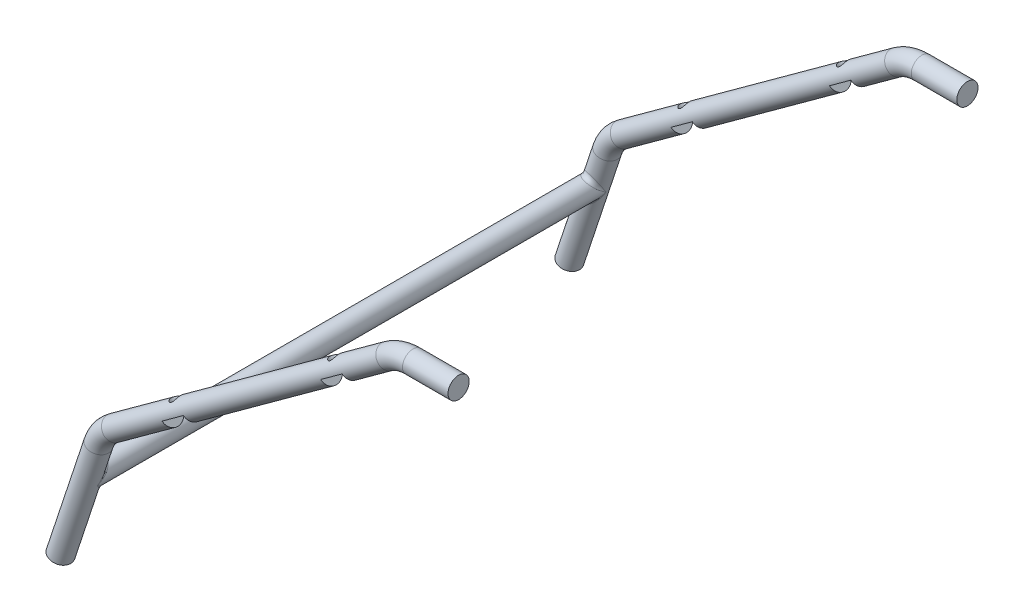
ISO-10303-21;
HEADER;
FILE_DESCRIPTION(('STEP AP214'),'2;1');
FILE_NAME('part.step','',(''),(''),'','','');
FILE_SCHEMA(('AUTOMOTIVE_DESIGN { 1 0 10303 214 1 1 1 1 }'));
ENDSEC;
DATA;
#1=APPLICATION_CONTEXT('core data for automotive mechanical design processes');
#2=APPLICATION_PROTOCOL_DEFINITION('international standard','automotive_design',2000,#1);
#3=PRODUCT_CONTEXT('',#1,'mechanical');
#4=PRODUCT('Part','Part','',(#3));
#5=PRODUCT_RELATED_PRODUCT_CATEGORY('part','',(#4));
#6=PRODUCT_DEFINITION_FORMATION('','',#4);
#7=PRODUCT_DEFINITION_CONTEXT('part definition',#1,'design');
#8=PRODUCT_DEFINITION('design','',#6,#7);
#9=PRODUCT_DEFINITION_SHAPE('','',#8);
#10=(LENGTH_UNIT() NAMED_UNIT(*) SI_UNIT(.MILLI.,.METRE.));
#11=(NAMED_UNIT(*) PLANE_ANGLE_UNIT() SI_UNIT($,.RADIAN.));
#12=(NAMED_UNIT(*) SI_UNIT($,.STERADIAN.) SOLID_ANGLE_UNIT());
#13=UNCERTAINTY_MEASURE_WITH_UNIT(LENGTH_MEASURE(1.E-05),#10,'distance_accuracy_value','');
#14=(GEOMETRIC_REPRESENTATION_CONTEXT(3) GLOBAL_UNCERTAINTY_ASSIGNED_CONTEXT((#13)) GLOBAL_UNIT_ASSIGNED_CONTEXT((#10,
#11,#12)) REPRESENTATION_CONTEXT('',''));
#15=CARTESIAN_POINT('',(0.,0.,0.));
#16=DIRECTION('',(0.,0.,1.));
#17=DIRECTION('',(1.,0.,0.));
#18=AXIS2_PLACEMENT_3D('',#15,#16,#17);
#19=CARTESIAN_POINT('',(-21.1028611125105,-2.42808196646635,0.));
#20=DIRECTION('',(-0.808812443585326,-0.588066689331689,0.));
#21=DIRECTION('',(0.588066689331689,-0.808812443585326,0.));
#22=AXIS2_PLACEMENT_3D('',#19,#20,#21);
#23=CYLINDRICAL_SURFACE('',#22,3.175);
#24=CARTESIAN_POINT('',(-103.27820538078,-62.1756576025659,0.));
#25=DIRECTION('',(0.808812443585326,0.588066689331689,0.));
#26=DIRECTION('',(0.,0.,-1.));
#27=AXIS2_PLACEMENT_3D('',#24,#25,#26);
#28=CIRCLE('',#27,3.175);
#29=CARTESIAN_POINT('',(-105.145317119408,-59.6076780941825,0.));
#30=VERTEX_POINT('',#29);
#31=EDGE_CURVE('E219',#30,#30,#28,.T.);
#32=ORIENTED_EDGE('',*,*,#31,.T.);
#33=EDGE_LOOP('',(#32));
#34=FACE_BOUND('',#33,.T.);
#35=CARTESIAN_POINT('',(-21.1028611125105,-2.42808196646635,0.));
#36=DIRECTION('',(0.808812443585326,0.588066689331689,0.));
#37=DIRECTION('',(0.,0.,-1.));
#38=AXIS2_PLACEMENT_3D('',#35,#36,#37);
#39=CIRCLE('',#38,3.175);
#40=CARTESIAN_POINT('',(-22.9699728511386,0.13989754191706,0.));
#41=VERTEX_POINT('',#40);
#42=EDGE_CURVE('E216',#41,#41,#39,.T.);
#43=ORIENTED_EDGE('',*,*,#42,.F.);
#44=EDGE_LOOP('',(#43));
#45=FACE_BOUND('',#44,.T.);
#46=CARTESIAN_POINT('',(-79.5608011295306,-44.9313440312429,0.));
#47=DIRECTION('',(0.808812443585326,0.588066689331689,0.));
#48=DIRECTION('',(-0.58806668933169,0.808812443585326,0.));
#49=AXIS2_PLACEMENT_3D('',#46,#47,#48);
#50=CIRCLE('',#49,3.175);
#51=CARTESIAN_POINT('',(-79.2620632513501,-45.3422207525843,3.13409652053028));
#52=VERTEX_POINT('',#51);
#53=CARTESIAN_POINT('',(-79.2620632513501,-45.3422207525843,-3.13409652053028));
#54=VERTEX_POINT('',#53);
#55=EDGE_CURVE('E138',#52,#54,#50,.T.);
#56=ORIENTED_EDGE('',*,*,#55,.T.);
#57=DIRECTION('',(-0.808812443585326,-0.588066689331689,0.));
#58=VECTOR('',#57,1.);
#59=CARTESIAN_POINT('',(-20.80412323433,-2.83895868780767,-3.13409652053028));
#60=LINE('',#59,#58);
#61=CARTESIAN_POINT('',(-85.6717401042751,-50.0025316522,-3.13409652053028));
#62=VERTEX_POINT('',#61);
#63=EDGE_CURVE('E135',#54,#62,#60,.T.);
#64=ORIENTED_EDGE('',*,*,#63,.T.);
#65=CARTESIAN_POINT('',(-85.9704779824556,-49.5916549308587,0.));
#66=DIRECTION('',(-0.808812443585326,-0.588066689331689,0.));
#67=DIRECTION('',(0.58806668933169,-0.808812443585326,0.));
#68=AXIS2_PLACEMENT_3D('',#65,#66,#67);
#69=CIRCLE('',#68,3.175);
#70=CARTESIAN_POINT('',(-85.6717401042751,-50.0025316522,3.13409652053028));
#71=VERTEX_POINT('',#70);
#72=EDGE_CURVE('E141',#62,#71,#69,.T.);
#73=ORIENTED_EDGE('',*,*,#72,.T.);
#74=DIRECTION('',(-0.808812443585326,-0.588066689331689,0.));
#75=VECTOR('',#74,1.);
#76=CARTESIAN_POINT('',(-20.80412323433,-2.83895868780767,3.13409652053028));
#77=LINE('',#76,#75);
#78=EDGE_CURVE('E132',#71,#52,#77,.F.);
#79=ORIENTED_EDGE('',*,*,#78,.T.);
#80=EDGE_LOOP('',(#56,#64,#73,#79));
#81=FACE_BOUND('',#80,.T.);
#82=CARTESIAN_POINT('',(-32.063452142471,-10.3972453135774,0.));
#83=DIRECTION('',(0.808812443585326,0.588066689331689,0.));
#84=DIRECTION('',(-0.588066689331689,0.808812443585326,0.));
#85=AXIS2_PLACEMENT_3D('',#82,#83,#84);
#86=CIRCLE('',#85,3.175);
#87=CARTESIAN_POINT('',(-31.7647142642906,-10.8081220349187,3.13409652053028));
#88=VERTEX_POINT('',#87);
#89=CARTESIAN_POINT('',(-31.7647142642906,-10.8081220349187,-3.13409652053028));
#90=VERTEX_POINT('',#89);
#91=EDGE_CURVE('E111',#88,#90,#86,.T.);
#92=ORIENTED_EDGE('',*,*,#91,.T.);
#93=DIRECTION('',(-0.808812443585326,-0.588066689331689,0.));
#94=VECTOR('',#93,1.);
#95=CARTESIAN_POINT('',(-20.80412323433,-2.83895868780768,-3.13409652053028));
#96=LINE('',#95,#94);
#97=CARTESIAN_POINT('',(-38.1743911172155,-15.4684329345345,-3.13409652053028));
#98=VERTEX_POINT('',#97);
#99=EDGE_CURVE('E104',#90,#98,#96,.T.);
#100=ORIENTED_EDGE('',*,*,#99,.T.);
#101=CARTESIAN_POINT('',(-38.473128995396,-15.0575562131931,0.));
#102=DIRECTION('',(-0.808812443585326,-0.588066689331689,0.));
#103=DIRECTION('',(0.588066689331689,-0.808812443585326,0.));
#104=AXIS2_PLACEMENT_3D('',#101,#102,#103);
#105=CIRCLE('',#104,3.175);
#106=CARTESIAN_POINT('',(-38.1743911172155,-15.4684329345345,3.13409652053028));
#107=VERTEX_POINT('',#106);
#108=EDGE_CURVE('E119',#98,#107,#105,.T.);
#109=ORIENTED_EDGE('',*,*,#108,.T.);
#110=DIRECTION('',(-0.808812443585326,-0.588066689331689,0.));
#111=VECTOR('',#110,1.);
#112=CARTESIAN_POINT('',(-20.80412323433,-2.83895868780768,3.13409652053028));
#113=LINE('',#112,#111);
#114=EDGE_CURVE('E112',#107,#88,#113,.F.);
#115=ORIENTED_EDGE('',*,*,#114,.T.);
#116=EDGE_LOOP('',(#92,#100,#109,#115));
#117=FACE_BOUND('',#116,.T.);
#118=CARTESIAN_POINT('',(-35.6973337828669,-9.11383868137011,0.));
#119=CARTESIAN_POINT('',(-35.6973326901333,-9.11383392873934,0.0921789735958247));
#120=CARTESIAN_POINT('',(-35.7007761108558,-9.12134635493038,0.184336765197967));
#121=CARTESIAN_POINT('',(-35.7144769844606,-9.15081560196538,0.365781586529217));
#122=CARTESIAN_POINT('',(-35.7247352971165,-9.17277424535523,0.45506825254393));
#123=CARTESIAN_POINT('',(-35.7518618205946,-9.22950971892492,0.627983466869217));
#124=CARTESIAN_POINT('',(-35.7687056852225,-9.26423930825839,0.711631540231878));
#125=CARTESIAN_POINT('',(-35.8088938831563,-9.34447040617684,0.871868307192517));
#126=CARTESIAN_POINT('',(-35.8322398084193,-9.38997455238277,0.948455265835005));
#127=CARTESIAN_POINT('',(-35.887357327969,-9.49301271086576,1.09842459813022));
#128=CARTESIAN_POINT('',(-35.9196055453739,-9.55116718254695,1.17120406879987));
#129=CARTESIAN_POINT('',(-35.9919972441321,-9.67451748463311,1.30619927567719));
#130=CARTESIAN_POINT('',(-36.0321488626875,-9.73972054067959,1.36840400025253));
#131=CARTESIAN_POINT('',(-36.1256025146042,-9.88128794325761,1.4869802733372));
#132=CARTESIAN_POINT('',(-36.1798349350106,-9.95810928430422,1.54208392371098));
#133=CARTESIAN_POINT('',(-36.2997258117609,-10.1126176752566,1.63629674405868));
#134=CARTESIAN_POINT('',(-36.3653674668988,-10.190303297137,1.6754291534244));
#135=CARTESIAN_POINT('',(-36.4931284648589,-10.3256098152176,1.72929563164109));
#136=CARTESIAN_POINT('',(-36.5530140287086,-10.3839768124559,1.74745302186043));
#137=CARTESIAN_POINT('',(-36.6793530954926,-10.495860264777,1.77178512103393));
#138=CARTESIAN_POINT('',(-36.7457999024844,-10.5493815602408,1.77797191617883));
#139=CARTESIAN_POINT('',(-36.8837095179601,-10.6496990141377,1.77802793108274));
#140=CARTESIAN_POINT('',(-36.9551780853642,-10.6964872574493,1.77188277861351));
#141=CARTESIAN_POINT('',(-37.1007022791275,-10.7823078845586,1.7476017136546));
#142=CARTESIAN_POINT('',(-37.1747595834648,-10.82133512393,1.72945788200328));
#143=CARTESIAN_POINT('',(-37.322832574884,-10.8916807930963,1.68207169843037));
#144=CARTESIAN_POINT('',(-37.3968482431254,-10.9230058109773,1.65283888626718));
#145=CARTESIAN_POINT('',(-37.5427166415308,-10.9788332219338,1.58427616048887));
#146=CARTESIAN_POINT('',(-37.6145685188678,-11.0033329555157,1.54494232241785));
#147=CARTESIAN_POINT('',(-37.7650303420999,-11.0499366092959,1.45027160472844));
#148=CARTESIAN_POINT('',(-37.8429725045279,-11.0710876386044,1.3934019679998));
#149=CARTESIAN_POINT('',(-37.990964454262,-11.1073740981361,1.26848222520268));
#150=CARTESIAN_POINT('',(-38.0610077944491,-11.1225046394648,1.20042309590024));
#151=CARTESIAN_POINT('',(-38.1974629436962,-11.1494362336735,1.04648311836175));
#152=CARTESIAN_POINT('',(-38.2627254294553,-11.1607223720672,0.959482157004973));
#153=CARTESIAN_POINT('',(-38.3769227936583,-11.1789742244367,0.774924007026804));
#154=CARTESIAN_POINT('',(-38.4258683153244,-11.1859427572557,0.677373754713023));
#155=CARTESIAN_POINT('',(-38.5013103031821,-11.1961513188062,0.481608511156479));
#156=CARTESIAN_POINT('',(-38.5291462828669,-11.1996195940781,0.383925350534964));
#157=CARTESIAN_POINT('',(-38.5657261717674,-11.204105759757,0.185014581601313));
#158=CARTESIAN_POINT('',(-38.5744874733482,-11.2051258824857,0.0837902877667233));
#159=CARTESIAN_POINT('',(-38.5723913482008,-11.2048744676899,-0.106691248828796));
#160=CARTESIAN_POINT('',(-38.5636838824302,-11.2038541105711,-0.195979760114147));
#161=CARTESIAN_POINT('',(-38.5314072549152,-11.1998980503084,-0.371770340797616));
#162=CARTESIAN_POINT('',(-38.5078376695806,-11.196962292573,-0.458272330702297));
#163=CARTESIAN_POINT('',(-38.4473757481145,-11.1889001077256,-0.625796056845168));
#164=CARTESIAN_POINT('',(-38.4105563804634,-11.1837856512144,-0.706844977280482));
#165=CARTESIAN_POINT('',(-38.3253776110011,-11.1708906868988,-0.862372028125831));
#166=CARTESIAN_POINT('',(-38.2770152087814,-11.1631094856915,-0.936848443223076));
#167=CARTESIAN_POINT('',(-38.1651579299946,-11.1432384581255,-1.08540243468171));
#168=CARTESIAN_POINT('',(-38.1006151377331,-11.1307861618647,-1.15864161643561));
#169=CARTESIAN_POINT('',(-37.9622787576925,-11.1006400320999,-1.29465767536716));
#170=CARTESIAN_POINT('',(-37.8884748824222,-11.0829403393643,-1.35742273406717));
#171=CARTESIAN_POINT('',(-37.7260916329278,-11.0386339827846,-1.47731138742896));
#172=CARTESIAN_POINT('',(-37.6367737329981,-11.0112937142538,-1.53317397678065));
#173=CARTESIAN_POINT('',(-37.4535774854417,-10.9461670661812,-1.62905797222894));
#174=CARTESIAN_POINT('',(-37.3597057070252,-10.9083953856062,-1.66910147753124));
#175=CARTESIAN_POINT('',(-37.1915160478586,-10.8298102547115,-1.72484670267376));
#176=CARTESIAN_POINT('',(-37.1172313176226,-10.7913010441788,-1.74389417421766));
#177=CARTESIAN_POINT('',(-36.9710851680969,-10.7064694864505,-1.7699867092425));
#178=CARTESIAN_POINT('',(-36.8992213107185,-10.660155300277,-1.77704422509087));
#179=CARTESIAN_POINT('',(-36.7602043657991,-10.5605257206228,-1.77877505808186));
#180=CARTESIAN_POINT('',(-36.6930582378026,-10.507200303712,-1.77343045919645));
#181=CARTESIAN_POINT('',(-36.5653097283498,-10.3955173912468,-1.7506329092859));
#182=CARTESIAN_POINT('',(-36.5047115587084,-10.3371566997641,-1.73317221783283));
#183=CARTESIAN_POINT('',(-36.3912321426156,-10.2182860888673,-1.68715880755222));
#184=CARTESIAN_POINT('',(-36.3383011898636,-10.1577934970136,-1.65868237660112));
#185=CARTESIAN_POINT('',(-36.2395764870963,-10.0366177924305,-1.59162830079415));
#186=CARTESIAN_POINT('',(-36.1937854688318,-9.97593461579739,-1.55304680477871));
#187=CARTESIAN_POINT('',(-36.1024480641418,-9.84740742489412,-1.46010200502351));
#188=CARTESIAN_POINT('',(-36.0579945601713,-9.77987518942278,-1.40423190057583));
#189=CARTESIAN_POINT('',(-35.9772041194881,-9.65022808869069,-1.28135858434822));
#190=CARTESIAN_POINT('',(-35.9408738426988,-9.58811769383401,-1.21434631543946));
#191=CARTESIAN_POINT('',(-35.8722512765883,-9.46573661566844,-1.06228720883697));
#192=CARTESIAN_POINT('',(-35.8408384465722,-9.40641427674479,-0.976068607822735));
#193=CARTESIAN_POINT('',(-35.7871463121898,-9.30171335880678,-0.792951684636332));
#194=CARTESIAN_POINT('',(-35.7648615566,-9.25632646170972,-0.696059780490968));
#195=CARTESIAN_POINT('',(-35.7306734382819,-9.18539787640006,-0.500787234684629));
#196=CARTESIAN_POINT('',(-35.7181911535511,-9.15876120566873,-0.402909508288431));
#197=CARTESIAN_POINT('',(-35.7015256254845,-9.12299202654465,-0.203343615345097));
#198=CARTESIAN_POINT('',(-35.6973349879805,-9.11384392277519,-0.101658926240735));
#199=CARTESIAN_POINT('',(-35.6973337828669,-9.11383868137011,0.));
#200=B_SPLINE_CURVE_WITH_KNOTS('',3,(#118,#119,#120,#121,#122,#123,#124,#125,#126,#127,#128,
#129,#130,#131,#132,#133,#134,#135,#136,#137,#138,#139,#140,#141,#142,#143,#144,#145,#146,#147,
#148,#149,#150,#151,#152,#153,#154,#155,#156,#157,#158,#159,#160,#161,#162,#163,#164,#165,#166,
#167,#168,#169,#170,#171,#172,#173,#174,#175,#176,#177,#178,#179,#180,#181,#182,#183,#184,#185,
#186,#187,#188,#189,#190,#191,#192,#193,#194,#195,#196,#197,#198,#199),.UNSPECIFIED.,.T.,.F.,(4,
2,2,2,2,2,2,2,2,2,2,2,2,2,2,2,2,2,2,2,2,2,2,2,2,2,2,2,2,2,2,2,2,2,2,2,2,2,2,2,4),(0.,
0.276143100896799,0.55232104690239,0.827487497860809,1.10272137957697,1.39728688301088,
1.69215726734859,2.01751223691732,2.34239208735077,2.59799368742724,2.85333708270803,
3.1089782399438,3.36478828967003,3.62037876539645,3.87606869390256,4.17120940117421,
4.46658928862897,4.79291611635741,5.11902966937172,5.42214956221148,5.7249929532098,
5.99284285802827,6.26070039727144,6.52710483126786,6.79357858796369,7.08762066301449,
7.38199230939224,7.70690653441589,8.03136523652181,8.28769212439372,8.54375263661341,
8.80018328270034,9.05677790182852,9.31162643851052,9.56657224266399,9.86022916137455,
10.1541259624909,10.4802458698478,10.8061707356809,11.1109851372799,11.4155275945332),.UNSPECIFIED.);
#201=CARTESIAN_POINT('',(-35.6973337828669,-9.11383868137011,0.));
#202=VERTEX_POINT('',#201);
#203=EDGE_CURVE('E275',#202,#202,#200,.T.);
#204=ORIENTED_EDGE('',*,*,#203,.T.);
#205=EDGE_LOOP('',(#204));
#206=FACE_BOUND('',#205,.T.);
#207=CARTESIAN_POINT('',(-83.1946827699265,-43.6479373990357,0.));
#208=CARTESIAN_POINT('',(-83.1946816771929,-43.6479326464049,-0.0921789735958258));
#209=CARTESIAN_POINT('',(-83.1981250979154,-43.6554450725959,-0.184336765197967));
#210=CARTESIAN_POINT('',(-83.2118259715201,-43.6849143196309,-0.365781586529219));
#211=CARTESIAN_POINT('',(-83.222084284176,-43.7068729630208,-0.455068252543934));
#212=CARTESIAN_POINT('',(-83.2492108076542,-43.7636084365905,-0.627983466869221));
#213=CARTESIAN_POINT('',(-83.2660546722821,-43.7983380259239,-0.711631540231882));
#214=CARTESIAN_POINT('',(-83.3062428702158,-43.8785691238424,-0.87186830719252));
#215=CARTESIAN_POINT('',(-83.3295887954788,-43.9240732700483,-0.948455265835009));
#216=CARTESIAN_POINT('',(-83.3847063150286,-44.0271114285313,-1.09842459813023));
#217=CARTESIAN_POINT('',(-83.4169545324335,-44.0852659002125,-1.17120406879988));
#218=CARTESIAN_POINT('',(-83.4893462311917,-44.2086162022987,-1.3061992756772));
#219=CARTESIAN_POINT('',(-83.5294978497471,-44.2738192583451,-1.36840400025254));
#220=CARTESIAN_POINT('',(-83.6229515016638,-44.4153866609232,-1.48698027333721));
#221=CARTESIAN_POINT('',(-83.6771839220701,-44.4922080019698,-1.54208392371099));
#222=CARTESIAN_POINT('',(-83.7970747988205,-44.6467163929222,-1.63629674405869));
#223=CARTESIAN_POINT('',(-83.8627164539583,-44.7244020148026,-1.67542915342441));
#224=CARTESIAN_POINT('',(-83.9904774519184,-44.8597085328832,-1.72929563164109));
#225=CARTESIAN_POINT('',(-84.0503630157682,-44.9180755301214,-1.74745302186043));
#226=CARTESIAN_POINT('',(-84.1767020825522,-45.0299589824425,-1.77178512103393));
#227=CARTESIAN_POINT('',(-84.243148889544,-45.0834802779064,-1.77797191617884));
#228=CARTESIAN_POINT('',(-84.3810585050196,-45.1837977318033,-1.77802793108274));
#229=CARTESIAN_POINT('',(-84.4525270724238,-45.2305859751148,-1.77188277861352));
#230=CARTESIAN_POINT('',(-84.5980512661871,-45.3164066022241,-1.7476017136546));
#231=CARTESIAN_POINT('',(-84.6721085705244,-45.3554338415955,-1.72945788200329));
#232=CARTESIAN_POINT('',(-84.8201815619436,-45.4257795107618,-1.68207169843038));
#233=CARTESIAN_POINT('',(-84.8941972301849,-45.4571045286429,-1.65283888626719));
#234=CARTESIAN_POINT('',(-85.0400656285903,-45.5129319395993,-1.58427616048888));
#235=CARTESIAN_POINT('',(-85.1119175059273,-45.5374316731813,-1.54494232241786));
#236=CARTESIAN_POINT('',(-85.2623793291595,-45.5840353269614,-1.45027160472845));
#237=CARTESIAN_POINT('',(-85.3403214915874,-45.6051863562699,-1.39340196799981));
#238=CARTESIAN_POINT('',(-85.4883134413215,-45.6414728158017,-1.2684822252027));
#239=CARTESIAN_POINT('',(-85.5583567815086,-45.6566033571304,-1.20042309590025));
#240=CARTESIAN_POINT('',(-85.6948119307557,-45.6835349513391,-1.04648311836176));
#241=CARTESIAN_POINT('',(-85.7600744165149,-45.6948210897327,-0.959482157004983));
#242=CARTESIAN_POINT('',(-85.8742717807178,-45.7130729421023,-0.774924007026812));
#243=CARTESIAN_POINT('',(-85.9232173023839,-45.7200414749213,-0.677373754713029));
#244=CARTESIAN_POINT('',(-85.9986592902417,-45.7302500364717,-0.481608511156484));
#245=CARTESIAN_POINT('',(-86.0264952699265,-45.7337183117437,-0.383925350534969));
#246=CARTESIAN_POINT('',(-86.063075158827,-45.7382044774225,-0.18501458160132));
#247=CARTESIAN_POINT('',(-86.0718364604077,-45.7392246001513,-0.0837902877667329));
#248=CARTESIAN_POINT('',(-86.0697403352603,-45.7389731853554,0.106691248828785));
#249=CARTESIAN_POINT('',(-86.0610328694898,-45.7379528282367,0.195979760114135));
#250=CARTESIAN_POINT('',(-86.0287562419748,-45.733996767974,0.371770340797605));
#251=CARTESIAN_POINT('',(-86.0051866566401,-45.7310610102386,0.458272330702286));
#252=CARTESIAN_POINT('',(-85.944724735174,-45.7229988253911,0.625796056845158));
#253=CARTESIAN_POINT('',(-85.9079053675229,-45.7178843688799,0.706844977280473));
#254=CARTESIAN_POINT('',(-85.8227265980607,-45.7049894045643,0.862372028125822));
#255=CARTESIAN_POINT('',(-85.7743641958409,-45.697208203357,0.936848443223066));
#256=CARTESIAN_POINT('',(-85.6625069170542,-45.6773371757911,1.0854024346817));
#257=CARTESIAN_POINT('',(-85.5979641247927,-45.6648848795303,1.1586416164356));
#258=CARTESIAN_POINT('',(-85.4596277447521,-45.6347387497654,1.29465767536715));
#259=CARTESIAN_POINT('',(-85.3858238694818,-45.6170390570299,1.35742273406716));
#260=CARTESIAN_POINT('',(-85.2234406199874,-45.5727327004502,1.47731138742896));
#261=CARTESIAN_POINT('',(-85.1341227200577,-45.5453924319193,1.53317397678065));
#262=CARTESIAN_POINT('',(-84.9509264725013,-45.4802657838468,1.62905797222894));
#263=CARTESIAN_POINT('',(-84.8570546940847,-45.4424941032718,1.66910147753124));
#264=CARTESIAN_POINT('',(-84.6888650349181,-45.3639089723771,1.72484670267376));
#265=CARTESIAN_POINT('',(-84.6145803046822,-45.3253997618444,1.74389417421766));
#266=CARTESIAN_POINT('',(-84.4684341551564,-45.240568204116,1.76998670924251));
#267=CARTESIAN_POINT('',(-84.396570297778,-45.1942540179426,1.77704422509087));
#268=CARTESIAN_POINT('',(-84.2575533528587,-45.0946244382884,1.77877505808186));
#269=CARTESIAN_POINT('',(-84.1904072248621,-45.0412990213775,1.77343045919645));
#270=CARTESIAN_POINT('',(-84.0626587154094,-44.9296161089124,1.75063290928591));
#271=CARTESIAN_POINT('',(-84.002060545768,-44.8712554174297,1.73317221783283));
#272=CARTESIAN_POINT('',(-83.8885811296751,-44.7523848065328,1.68715880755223));
#273=CARTESIAN_POINT('',(-83.8356501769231,-44.6918922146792,1.65868237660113));
#274=CARTESIAN_POINT('',(-83.7369254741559,-44.5707165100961,1.59162830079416));
#275=CARTESIAN_POINT('',(-83.6911344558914,-44.510033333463,1.55304680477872));
#276=CARTESIAN_POINT('',(-83.5997970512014,-44.3815061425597,1.46010200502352));
#277=CARTESIAN_POINT('',(-83.5553435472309,-44.3139739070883,1.40423190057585));
#278=CARTESIAN_POINT('',(-83.4745531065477,-44.1843268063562,1.28135858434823));
#279=CARTESIAN_POINT('',(-83.4382228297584,-44.1222164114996,1.21434631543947));
#280=CARTESIAN_POINT('',(-83.3696002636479,-43.999835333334,1.06228720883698));
#281=CARTESIAN_POINT('',(-83.3381874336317,-43.9405129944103,0.976068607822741));
#282=CARTESIAN_POINT('',(-83.2844952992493,-43.8358120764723,0.792951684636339));
#283=CARTESIAN_POINT('',(-83.2622105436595,-43.7904251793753,0.696059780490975));
#284=CARTESIAN_POINT('',(-83.2280224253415,-43.7194965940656,0.500787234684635));
#285=CARTESIAN_POINT('',(-83.2155401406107,-43.6928599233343,0.402909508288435));
#286=CARTESIAN_POINT('',(-83.198874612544,-43.6570907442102,0.203343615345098));
#287=CARTESIAN_POINT('',(-83.19468397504,-43.6479426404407,0.101658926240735));
#288=CARTESIAN_POINT('',(-83.1946827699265,-43.6479373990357,0.));
#289=B_SPLINE_CURVE_WITH_KNOTS('',3,(#207,#208,#209,#210,#211,#212,#213,#214,#215,#216,#217,
#218,#219,#220,#221,#222,#223,#224,#225,#226,#227,#228,#229,#230,#231,#232,#233,#234,#235,#236,
#237,#238,#239,#240,#241,#242,#243,#244,#245,#246,#247,#248,#249,#250,#251,#252,#253,#254,#255,
#256,#257,#258,#259,#260,#261,#262,#263,#264,#265,#266,#267,#268,#269,#270,#271,#272,#273,#274,
#275,#276,#277,#278,#279,#280,#281,#282,#283,#284,#285,#286,#287,#288),.UNSPECIFIED.,.T.,.F.,(4,
2,2,2,2,2,2,2,2,2,2,2,2,2,2,2,2,2,2,2,2,2,2,2,2,2,2,2,2,2,2,2,2,2,2,2,2,2,2,2,4),(0.,
0.2761431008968,0.552321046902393,0.827487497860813,1.10272137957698,1.39728688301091,
1.6921572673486,2.01751223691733,2.34239208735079,2.59799368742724,2.85333708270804,
3.10897823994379,3.36478828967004,3.62037876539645,3.87606869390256,4.1712094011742,
4.46658928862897,4.79291611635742,5.11902966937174,5.42214956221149,5.7249929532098,
5.99284285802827,6.26070039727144,6.52710483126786,6.79357858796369,7.08762066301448,
7.38199230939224,7.7069065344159,8.03136523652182,8.28769212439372,8.54375263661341,
8.80018328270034,9.05677790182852,9.31162643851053,9.56657224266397,9.86022916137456,
10.1541259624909,10.4802458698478,10.8061707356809,11.11098513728,11.4155275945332),.UNSPECIFIED.);
#290=CARTESIAN_POINT('',(-83.1946827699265,-43.6479373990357,0.));
#291=VERTEX_POINT('',#290);
#292=EDGE_CURVE('E390',#291,#291,#289,.T.);
#293=ORIENTED_EDGE('',*,*,#292,.F.);
#294=EDGE_LOOP('',(#293));
#295=FACE_BOUND('',#294,.T.);
#296=ADVANCED_FACE('F28',(#34,#45,#81,#117,#206,#295),#23,.T.);
#297=CARTESIAN_POINT('',(-85.6717401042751,-50.0025316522,3.175));
#298=DIRECTION('',(-0.588066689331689,0.808812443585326,0.));
#299=DIRECTION('',(-0.808812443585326,-0.588066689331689,0.));
#300=AXIS2_PLACEMENT_3D('',#297,#298,#299);
#301=PLANE('',#300);
#302=DIRECTION('',(0.,0.,-1.));
#303=VECTOR('',#302,1.);
#304=CARTESIAN_POINT('',(-79.2620632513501,-45.3422207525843,3.175));
#305=LINE('',#304,#303);
#306=EDGE_CURVE('E128',#52,#54,#305,.T.);
#307=ORIENTED_EDGE('',*,*,#306,.F.);
#308=ORIENTED_EDGE('',*,*,#78,.F.);
#309=DIRECTION('',(0.,0.,-1.));
#310=VECTOR('',#309,1.);
#311=CARTESIAN_POINT('',(-85.6717401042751,-50.0025316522,3.175));
#312=LINE('',#311,#310);
#313=EDGE_CURVE('E129',#71,#62,#312,.T.);
#314=ORIENTED_EDGE('',*,*,#313,.T.);
#315=ORIENTED_EDGE('',*,*,#63,.F.);
#316=EDGE_LOOP('',(#307,#308,#314,#315));
#317=FACE_BOUND('',#316,.T.);
#318=CARTESIAN_POINT('',(-82.4669016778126,-47.6723762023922,0.));
#319=DIRECTION('',(-0.588066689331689,0.808812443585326,0.));
#320=DIRECTION('',(-0.808812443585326,-0.588066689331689,0.));
#321=AXIS2_PLACEMENT_3D('',#318,#319,#320);
#322=CIRCLE('',#321,1.778);
#323=CARTESIAN_POINT('',(-83.9049702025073,-48.7179587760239,0.));
#324=VERTEX_POINT('',#323);
#325=EDGE_CURVE('E379',#324,#324,#322,.T.);
#326=ORIENTED_EDGE('',*,*,#325,.T.);
#327=EDGE_LOOP('',(#326));
#328=FACE_BOUND('',#327,.T.);
#329=ADVANCED_FACE('F315',(#317,#328),#301,.F.);
#330=CARTESIAN_POINT('',(-21.1028611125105,-2.42808196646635,-152.4));
#331=DIRECTION('',(-0.808812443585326,-0.588066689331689,0.));
#332=DIRECTION('',(0.588066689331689,-0.808812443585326,0.));
#333=AXIS2_PLACEMENT_3D('',#330,#331,#332);
#334=CYLINDRICAL_SURFACE('',#333,3.175);
#335=CARTESIAN_POINT('',(-83.1946827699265,-43.6479373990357,-152.4));
#336=CARTESIAN_POINT('',(-83.1946816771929,-43.6479326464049,-152.492178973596));
#337=CARTESIAN_POINT('',(-83.1981250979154,-43.6554450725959,-152.584336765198));
#338=CARTESIAN_POINT('',(-83.2118259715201,-43.6849143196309,-152.765781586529));
#339=CARTESIAN_POINT('',(-83.222084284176,-43.7068729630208,-152.855068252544));
#340=CARTESIAN_POINT('',(-83.2492108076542,-43.7636084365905,-153.027983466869));
#341=CARTESIAN_POINT('',(-83.2660546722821,-43.7983380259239,-153.111631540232));
#342=CARTESIAN_POINT('',(-83.3062428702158,-43.8785691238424,-153.271868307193));
#343=CARTESIAN_POINT('',(-83.3295887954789,-43.9240732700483,-153.348455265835));
#344=CARTESIAN_POINT('',(-83.3847063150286,-44.0271114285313,-153.49842459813));
#345=CARTESIAN_POINT('',(-83.4169545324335,-44.0852659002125,-153.5712040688));
#346=CARTESIAN_POINT('',(-83.4893462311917,-44.2086162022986,-153.706199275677));
#347=CARTESIAN_POINT('',(-83.5294978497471,-44.2738192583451,-153.768404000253));
#348=CARTESIAN_POINT('',(-83.6229515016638,-44.4153866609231,-153.886980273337));
#349=CARTESIAN_POINT('',(-83.6771839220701,-44.4922080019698,-153.942083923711));
#350=CARTESIAN_POINT('',(-83.7970747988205,-44.6467163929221,-154.036296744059));
#351=CARTESIAN_POINT('',(-83.8627164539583,-44.7244020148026,-154.075429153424));
#352=CARTESIAN_POINT('',(-83.9904774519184,-44.8597085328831,-154.129295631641));
#353=CARTESIAN_POINT('',(-84.0503630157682,-44.9180755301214,-154.14745302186));
#354=CARTESIAN_POINT('',(-84.1767020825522,-45.0299589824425,-154.171785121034));
#355=CARTESIAN_POINT('',(-84.243148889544,-45.0834802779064,-154.177971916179));
#356=CARTESIAN_POINT('',(-84.3810585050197,-45.1837977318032,-154.178027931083));
#357=CARTESIAN_POINT('',(-84.4525270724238,-45.2305859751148,-154.171882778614));
#358=CARTESIAN_POINT('',(-84.5980512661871,-45.3164066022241,-154.147601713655));
#359=CARTESIAN_POINT('',(-84.6721085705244,-45.3554338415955,-154.129457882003));
#360=CARTESIAN_POINT('',(-84.8201815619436,-45.4257795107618,-154.08207169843));
#361=CARTESIAN_POINT('',(-84.894197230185,-45.4571045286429,-154.052838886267));
#362=CARTESIAN_POINT('',(-85.0400656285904,-45.5129319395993,-153.984276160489));
#363=CARTESIAN_POINT('',(-85.1119175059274,-45.5374316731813,-153.944942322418));
#364=CARTESIAN_POINT('',(-85.2623793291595,-45.5840353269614,-153.850271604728));
#365=CARTESIAN_POINT('',(-85.3403214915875,-45.6051863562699,-153.793401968));
#366=CARTESIAN_POINT('',(-85.4883134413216,-45.6414728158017,-153.668482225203));
#367=CARTESIAN_POINT('',(-85.5583567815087,-45.6566033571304,-153.6004230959));
#368=CARTESIAN_POINT('',(-85.6948119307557,-45.683534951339,-153.446483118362));
#369=CARTESIAN_POINT('',(-85.7600744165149,-45.6948210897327,-153.359482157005));
#370=CARTESIAN_POINT('',(-85.8742717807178,-45.7130729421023,-153.174924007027));
#371=CARTESIAN_POINT('',(-85.9232173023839,-45.7200414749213,-153.077373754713));
#372=CARTESIAN_POINT('',(-85.9986592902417,-45.7302500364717,-152.881608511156));
#373=CARTESIAN_POINT('',(-86.0264952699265,-45.7337183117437,-152.783925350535));
#374=CARTESIAN_POINT('',(-86.063075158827,-45.7382044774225,-152.585014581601));
#375=CARTESIAN_POINT('',(-86.0718364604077,-45.7392246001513,-152.483790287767));
#376=CARTESIAN_POINT('',(-86.0697403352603,-45.7389731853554,-152.293308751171));
#377=CARTESIAN_POINT('',(-86.0610328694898,-45.7379528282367,-152.204020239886));
#378=CARTESIAN_POINT('',(-86.0287562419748,-45.733996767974,-152.028229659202));
#379=CARTESIAN_POINT('',(-86.0051866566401,-45.7310610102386,-151.941727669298));
#380=CARTESIAN_POINT('',(-85.944724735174,-45.7229988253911,-151.774203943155));
#381=CARTESIAN_POINT('',(-85.9079053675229,-45.7178843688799,-151.69315502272));
#382=CARTESIAN_POINT('',(-85.8227265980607,-45.7049894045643,-151.537627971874));
#383=CARTESIAN_POINT('',(-85.7743641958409,-45.697208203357,-151.463151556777));
#384=CARTESIAN_POINT('',(-85.6625069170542,-45.6773371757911,-151.314597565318));
#385=CARTESIAN_POINT('',(-85.5979641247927,-45.6648848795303,-151.241358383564));
#386=CARTESIAN_POINT('',(-85.4596277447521,-45.6347387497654,-151.105342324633));
#387=CARTESIAN_POINT('',(-85.3858238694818,-45.6170390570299,-151.042577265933));
#388=CARTESIAN_POINT('',(-85.2234406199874,-45.5727327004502,-150.922688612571));
#389=CARTESIAN_POINT('',(-85.1341227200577,-45.5453924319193,-150.866826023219));
#390=CARTESIAN_POINT('',(-84.9509264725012,-45.4802657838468,-150.770942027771));
#391=CARTESIAN_POINT('',(-84.8570546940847,-45.4424941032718,-150.730898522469));
#392=CARTESIAN_POINT('',(-84.6888650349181,-45.3639089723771,-150.675153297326));
#393=CARTESIAN_POINT('',(-84.6145803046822,-45.3253997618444,-150.656105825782));
#394=CARTESIAN_POINT('',(-84.4684341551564,-45.240568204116,-150.630013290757));
#395=CARTESIAN_POINT('',(-84.396570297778,-45.1942540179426,-150.622955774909));
#396=CARTESIAN_POINT('',(-84.2575533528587,-45.0946244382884,-150.621224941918));
#397=CARTESIAN_POINT('',(-84.1904072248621,-45.0412990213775,-150.626569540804));
#398=CARTESIAN_POINT('',(-84.0626587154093,-44.9296161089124,-150.649367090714));
#399=CARTESIAN_POINT('',(-84.0020605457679,-44.8712554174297,-150.666827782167));
#400=CARTESIAN_POINT('',(-83.8885811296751,-44.7523848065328,-150.712841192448));
#401=CARTESIAN_POINT('',(-83.8356501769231,-44.6918922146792,-150.741317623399));
#402=CARTESIAN_POINT('',(-83.7369254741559,-44.5707165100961,-150.808371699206));
#403=CARTESIAN_POINT('',(-83.6911344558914,-44.510033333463,-150.846953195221));
#404=CARTESIAN_POINT('',(-83.5997970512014,-44.3815061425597,-150.939897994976));
#405=CARTESIAN_POINT('',(-83.5553435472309,-44.3139739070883,-150.995768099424));
#406=CARTESIAN_POINT('',(-83.4745531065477,-44.1843268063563,-151.118641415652));
#407=CARTESIAN_POINT('',(-83.4382228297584,-44.1222164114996,-151.185653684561));
#408=CARTESIAN_POINT('',(-83.3696002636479,-43.999835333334,-151.337712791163));
#409=CARTESIAN_POINT('',(-83.3381874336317,-43.9405129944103,-151.423931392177));
#410=CARTESIAN_POINT('',(-83.2844952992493,-43.8358120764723,-151.607048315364));
#411=CARTESIAN_POINT('',(-83.2622105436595,-43.7904251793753,-151.703940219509));
#412=CARTESIAN_POINT('',(-83.2280224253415,-43.7194965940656,-151.899212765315));
#413=CARTESIAN_POINT('',(-83.2155401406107,-43.6928599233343,-151.997090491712));
#414=CARTESIAN_POINT('',(-83.198874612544,-43.6570907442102,-152.196656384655));
#415=CARTESIAN_POINT('',(-83.19468397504,-43.6479426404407,-152.298341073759));
#416=CARTESIAN_POINT('',(-83.1946827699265,-43.6479373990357,-152.4));
#417=B_SPLINE_CURVE_WITH_KNOTS('',3,(#335,#336,#337,#338,#339,#340,#341,#342,#343,#344,#345,
#346,#347,#348,#349,#350,#351,#352,#353,#354,#355,#356,#357,#358,#359,#360,#361,#362,#363,#364,
#365,#366,#367,#368,#369,#370,#371,#372,#373,#374,#375,#376,#377,#378,#379,#380,#381,#382,#383,
#384,#385,#386,#387,#388,#389,#390,#391,#392,#393,#394,#395,#396,#397,#398,#399,#400,#401,#402,
#403,#404,#405,#406,#407,#408,#409,#410,#411,#412,#413,#414,#415,#416),.UNSPECIFIED.,.T.,.F.,(4,
2,2,2,2,2,2,2,2,2,2,2,2,2,2,2,2,2,2,2,2,2,2,2,2,2,2,2,2,2,2,2,2,2,2,2,2,2,2,2,4),(0.,
0.276143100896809,0.552321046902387,0.827487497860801,1.10272137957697,1.39728688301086,
1.69215726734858,2.01751223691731,2.34239208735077,2.59799368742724,2.85333708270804,
3.10897823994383,3.36478828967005,3.62037876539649,3.87606869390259,4.17120940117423,
4.46658928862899,4.7929161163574,5.11902966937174,5.4221495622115,5.7249929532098,
5.99284285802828,6.26070039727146,6.52710483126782,6.7935785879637,7.0876206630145,
7.38199230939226,7.70690653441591,8.03136523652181,8.28769212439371,8.54375263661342,
8.80018328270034,9.05677790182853,9.31162643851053,9.56657224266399,9.86022916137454,
10.1541259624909,10.4802458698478,10.8061707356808,11.1109851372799,11.4155275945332),.UNSPECIFIED.);
#418=CARTESIAN_POINT('',(-83.1946827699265,-43.6479373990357,-152.4));
#419=VERTEX_POINT('',#418);
#420=EDGE_CURVE('E372',#419,#419,#417,.T.);
#421=ORIENTED_EDGE('',*,*,#420,.F.);
#422=EDGE_LOOP('',(#421));
#423=FACE_BOUND('',#422,.T.);
#424=CARTESIAN_POINT('',(-103.27820538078,-62.1756576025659,-152.4));
#425=DIRECTION('',(-0.808812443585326,-0.588066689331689,0.));
#426=DIRECTION('',(0.,0.,1.));
#427=AXIS2_PLACEMENT_3D('',#424,#425,#426);
#428=CIRCLE('',#427,3.175);
#429=CARTESIAN_POINT('',(-105.145317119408,-59.6076780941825,-152.4));
#430=VERTEX_POINT('',#429);
#431=EDGE_CURVE('E201',#430,#430,#428,.T.);
#432=ORIENTED_EDGE('',*,*,#431,.F.);
#433=EDGE_LOOP('',(#432));
#434=FACE_BOUND('',#433,.T.);
#435=CARTESIAN_POINT('',(-21.1028611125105,-2.42808196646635,-152.4));
#436=DIRECTION('',(-0.808812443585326,-0.588066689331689,0.));
#437=DIRECTION('',(0.,0.,1.));
#438=AXIS2_PLACEMENT_3D('',#435,#436,#437);
#439=CIRCLE('',#438,3.175);
#440=CARTESIAN_POINT('',(-22.9699728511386,0.13989754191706,-152.4));
#441=VERTEX_POINT('',#440);
#442=EDGE_CURVE('E198',#441,#441,#439,.T.);
#443=ORIENTED_EDGE('',*,*,#442,.T.);
#444=EDGE_LOOP('',(#443));
#445=FACE_BOUND('',#444,.T.);
#446=DIRECTION('',(-0.808812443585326,-0.588066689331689,0.));
#447=VECTOR('',#446,1.);
#448=CARTESIAN_POINT('',(-20.80412323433,-2.83895868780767,-155.53409652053));
#449=LINE('',#448,#447);
#450=CARTESIAN_POINT('',(-85.6717401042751,-50.0025316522,-155.53409652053));
#451=VERTEX_POINT('',#450);
#452=CARTESIAN_POINT('',(-79.2620632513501,-45.3422207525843,-155.53409652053));
#453=VERTEX_POINT('',#452);
#454=EDGE_CURVE('E259',#451,#453,#449,.F.);
#455=ORIENTED_EDGE('',*,*,#454,.F.);
#456=CARTESIAN_POINT('',(-85.9704779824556,-49.5916549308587,-152.4));
#457=DIRECTION('',(-0.808812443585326,-0.588066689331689,0.));
#458=DIRECTION('',(0.58806668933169,-0.808812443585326,0.));
#459=AXIS2_PLACEMENT_3D('',#456,#457,#458);
#460=CIRCLE('',#459,3.175);
#461=CARTESIAN_POINT('',(-85.6717401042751,-50.0025316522,-149.26590347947));
#462=VERTEX_POINT('',#461);
#463=EDGE_CURVE('E257',#462,#451,#460,.F.);
#464=ORIENTED_EDGE('',*,*,#463,.F.);
#465=DIRECTION('',(-0.808812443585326,-0.588066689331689,0.));
#466=VECTOR('',#465,1.);
#467=CARTESIAN_POINT('',(-20.80412323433,-2.83895868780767,-149.26590347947));
#468=LINE('',#467,#466);
#469=CARTESIAN_POINT('',(-79.2620632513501,-45.3422207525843,-149.26590347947));
#470=VERTEX_POINT('',#469);
#471=EDGE_CURVE('E252',#470,#462,#468,.T.);
#472=ORIENTED_EDGE('',*,*,#471,.F.);
#473=CARTESIAN_POINT('',(-79.5608011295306,-44.9313440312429,-152.4));
#474=DIRECTION('',(0.808812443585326,0.588066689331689,0.));
#475=DIRECTION('',(-0.58806668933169,0.808812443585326,0.));
#476=AXIS2_PLACEMENT_3D('',#473,#474,#475);
#477=CIRCLE('',#476,3.175);
#478=EDGE_CURVE('E254',#453,#470,#477,.F.);
#479=ORIENTED_EDGE('',*,*,#478,.F.);
#480=EDGE_LOOP('',(#455,#464,#472,#479));
#481=FACE_BOUND('',#480,.T.);
#482=DIRECTION('',(-0.808812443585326,-0.588066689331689,0.));
#483=VECTOR('',#482,1.);
#484=CARTESIAN_POINT('',(-20.80412323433,-2.83895868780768,-155.53409652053));
#485=LINE('',#484,#483);
#486=CARTESIAN_POINT('',(-38.1743911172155,-15.4684329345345,-155.53409652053));
#487=VERTEX_POINT('',#486);
#488=CARTESIAN_POINT('',(-31.7647142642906,-10.8081220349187,-155.53409652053));
#489=VERTEX_POINT('',#488);
#490=EDGE_CURVE('E11',#487,#489,#485,.F.);
#491=ORIENTED_EDGE('',*,*,#490,.F.);
#492=CARTESIAN_POINT('',(-38.473128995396,-15.0575562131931,-152.4));
#493=DIRECTION('',(-0.808812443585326,-0.588066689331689,0.));
#494=DIRECTION('',(0.588066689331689,-0.808812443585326,0.));
#495=AXIS2_PLACEMENT_3D('',#492,#493,#494);
#496=CIRCLE('',#495,3.175);
#497=CARTESIAN_POINT('',(-38.1743911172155,-15.4684329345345,-149.26590347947));
#498=VERTEX_POINT('',#497);
#499=EDGE_CURVE('E37',#498,#487,#496,.F.);
#500=ORIENTED_EDGE('',*,*,#499,.F.);
#501=DIRECTION('',(-0.808812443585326,-0.588066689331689,0.));
#502=VECTOR('',#501,1.);
#503=CARTESIAN_POINT('',(-20.80412323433,-2.83895868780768,-149.26590347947));
#504=LINE('',#503,#502);
#505=CARTESIAN_POINT('',(-31.7647142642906,-10.8081220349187,-149.26590347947));
#506=VERTEX_POINT('',#505);
#507=EDGE_CURVE('E261',#506,#498,#504,.T.);
#508=ORIENTED_EDGE('',*,*,#507,.F.);
#509=CARTESIAN_POINT('',(-32.063452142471,-10.3972453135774,-152.4));
#510=DIRECTION('',(0.808812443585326,0.588066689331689,0.));
#511=DIRECTION('',(-0.588066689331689,0.808812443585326,0.));
#512=AXIS2_PLACEMENT_3D('',#509,#510,#511);
#513=CIRCLE('',#512,3.175);
#514=EDGE_CURVE('E263',#489,#506,#513,.F.);
#515=ORIENTED_EDGE('',*,*,#514,.F.);
#516=EDGE_LOOP('',(#491,#500,#508,#515));
#517=FACE_BOUND('',#516,.T.);
#518=CARTESIAN_POINT('',(-35.6973337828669,-9.11383868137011,-152.4));
#519=CARTESIAN_POINT('',(-35.6973326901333,-9.11383392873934,-152.307821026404));
#520=CARTESIAN_POINT('',(-35.7007761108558,-9.12134635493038,-152.215663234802));
#521=CARTESIAN_POINT('',(-35.7144769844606,-9.15081560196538,-152.034218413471));
#522=CARTESIAN_POINT('',(-35.7247352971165,-9.17277424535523,-151.944931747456));
#523=CARTESIAN_POINT('',(-35.7518618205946,-9.22950971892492,-151.772016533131));
#524=CARTESIAN_POINT('',(-35.7687056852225,-9.2642393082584,-151.688368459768));
#525=CARTESIAN_POINT('',(-35.8088938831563,-9.34447040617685,-151.528131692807));
#526=CARTESIAN_POINT('',(-35.8322398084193,-9.38997455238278,-151.451544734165));
#527=CARTESIAN_POINT('',(-35.887357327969,-9.49301271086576,-151.30157540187));
#528=CARTESIAN_POINT('',(-35.9196055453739,-9.55116718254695,-151.2287959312));
#529=CARTESIAN_POINT('',(-35.9919972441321,-9.67451748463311,-151.093800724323));
#530=CARTESIAN_POINT('',(-36.0321488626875,-9.73972054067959,-151.031595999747));
#531=CARTESIAN_POINT('',(-36.1256025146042,-9.88128794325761,-150.913019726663));
#532=CARTESIAN_POINT('',(-36.1798349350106,-9.95810928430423,-150.857916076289));
#533=CARTESIAN_POINT('',(-36.2997258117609,-10.1126176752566,-150.763703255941));
#534=CARTESIAN_POINT('',(-36.3653674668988,-10.1903032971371,-150.724570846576));
#535=CARTESIAN_POINT('',(-36.4931284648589,-10.3256098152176,-150.670704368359));
#536=CARTESIAN_POINT('',(-36.5530140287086,-10.3839768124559,-150.65254697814));
#537=CARTESIAN_POINT('',(-36.6793530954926,-10.495860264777,-150.628214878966));
#538=CARTESIAN_POINT('',(-36.7457999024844,-10.5493815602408,-150.622028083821));
#539=CARTESIAN_POINT('',(-36.8837095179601,-10.6496990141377,-150.621972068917));
#540=CARTESIAN_POINT('',(-36.9551780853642,-10.6964872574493,-150.628117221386));
#541=CARTESIAN_POINT('',(-37.1007022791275,-10.7823078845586,-150.652398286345));
#542=CARTESIAN_POINT('',(-37.1747595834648,-10.82133512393,-150.670542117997));
#543=CARTESIAN_POINT('',(-37.322832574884,-10.8916807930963,-150.71792830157));
#544=CARTESIAN_POINT('',(-37.3968482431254,-10.9230058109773,-150.747161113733));
#545=CARTESIAN_POINT('',(-37.5427166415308,-10.9788332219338,-150.815723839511));
#546=CARTESIAN_POINT('',(-37.6145685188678,-11.0033329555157,-150.855057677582));
#547=CARTESIAN_POINT('',(-37.7650303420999,-11.0499366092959,-150.949728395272));
#548=CARTESIAN_POINT('',(-37.8429725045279,-11.0710876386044,-151.006598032));
#549=CARTESIAN_POINT('',(-37.990964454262,-11.1073740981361,-151.131517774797));
#550=CARTESIAN_POINT('',(-38.0610077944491,-11.1225046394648,-151.1995769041));
#551=CARTESIAN_POINT('',(-38.1974629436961,-11.1494362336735,-151.353516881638));
#552=CARTESIAN_POINT('',(-38.2627254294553,-11.1607223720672,-151.440517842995));
#553=CARTESIAN_POINT('',(-38.3769227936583,-11.1789742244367,-151.625075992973));
#554=CARTESIAN_POINT('',(-38.4258683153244,-11.1859427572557,-151.722626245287));
#555=CARTESIAN_POINT('',(-38.5013103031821,-11.1961513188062,-151.918391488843));
#556=CARTESIAN_POINT('',(-38.5291462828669,-11.1996195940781,-152.016074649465));
#557=CARTESIAN_POINT('',(-38.5657261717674,-11.204105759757,-152.214985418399));
#558=CARTESIAN_POINT('',(-38.5744874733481,-11.2051258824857,-152.316209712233));
#559=CARTESIAN_POINT('',(-38.5723913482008,-11.2048744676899,-152.506691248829));
#560=CARTESIAN_POINT('',(-38.5636838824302,-11.2038541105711,-152.595979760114));
#561=CARTESIAN_POINT('',(-38.5314072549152,-11.1998980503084,-152.771770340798));
#562=CARTESIAN_POINT('',(-38.5078376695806,-11.196962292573,-152.858272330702));
#563=CARTESIAN_POINT('',(-38.4473757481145,-11.1889001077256,-153.025796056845));
#564=CARTESIAN_POINT('',(-38.4105563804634,-11.1837856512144,-153.10684497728));
#565=CARTESIAN_POINT('',(-38.3253776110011,-11.1708906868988,-153.262372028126));
#566=CARTESIAN_POINT('',(-38.2770152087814,-11.1631094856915,-153.336848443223));
#567=CARTESIAN_POINT('',(-38.1651579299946,-11.1432384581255,-153.485402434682));
#568=CARTESIAN_POINT('',(-38.1006151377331,-11.1307861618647,-153.558641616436));
#569=CARTESIAN_POINT('',(-37.9622787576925,-11.1006400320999,-153.694657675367));
#570=CARTESIAN_POINT('',(-37.8884748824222,-11.0829403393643,-153.757422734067));
#571=CARTESIAN_POINT('',(-37.7260916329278,-11.0386339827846,-153.877311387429));
#572=CARTESIAN_POINT('',(-37.6367737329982,-11.0112937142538,-153.933173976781));
#573=CARTESIAN_POINT('',(-37.4535774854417,-10.9461670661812,-154.029057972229));
#574=CARTESIAN_POINT('',(-37.3597057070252,-10.9083953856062,-154.069101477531));
#575=CARTESIAN_POINT('',(-37.1915160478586,-10.8298102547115,-154.124846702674));
#576=CARTESIAN_POINT('',(-37.1172313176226,-10.7913010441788,-154.143894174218));
#577=CARTESIAN_POINT('',(-36.9710851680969,-10.7064694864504,-154.169986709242));
#578=CARTESIAN_POINT('',(-36.8992213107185,-10.660155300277,-154.177044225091));
#579=CARTESIAN_POINT('',(-36.7602043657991,-10.5605257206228,-154.178775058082));
#580=CARTESIAN_POINT('',(-36.6930582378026,-10.507200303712,-154.173430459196));
#581=CARTESIAN_POINT('',(-36.5653097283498,-10.3955173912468,-154.150632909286));
#582=CARTESIAN_POINT('',(-36.5047115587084,-10.3371566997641,-154.133172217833));
#583=CARTESIAN_POINT('',(-36.3912321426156,-10.2182860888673,-154.087158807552));
#584=CARTESIAN_POINT('',(-36.3383011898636,-10.1577934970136,-154.058682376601));
#585=CARTESIAN_POINT('',(-36.2395764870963,-10.0366177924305,-153.991628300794));
#586=CARTESIAN_POINT('',(-36.1937854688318,-9.97593461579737,-153.953046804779));
#587=CARTESIAN_POINT('',(-36.1024480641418,-9.84740742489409,-153.860102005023));
#588=CARTESIAN_POINT('',(-36.0579945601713,-9.77987518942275,-153.804231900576));
#589=CARTESIAN_POINT('',(-35.9772041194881,-9.65022808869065,-153.681358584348));
#590=CARTESIAN_POINT('',(-35.9408738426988,-9.58811769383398,-153.614346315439));
#591=CARTESIAN_POINT('',(-35.8722512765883,-9.46573661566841,-153.462287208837));
#592=CARTESIAN_POINT('',(-35.8408384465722,-9.40641427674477,-153.376068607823));
#593=CARTESIAN_POINT('',(-35.7871463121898,-9.30171335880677,-153.192951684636));
#594=CARTESIAN_POINT('',(-35.7648615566,-9.25632646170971,-153.096059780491));
#595=CARTESIAN_POINT('',(-35.7306734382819,-9.18539787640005,-152.900787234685));
#596=CARTESIAN_POINT('',(-35.7181911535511,-9.15876120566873,-152.802909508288));
#597=CARTESIAN_POINT('',(-35.7015256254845,-9.12299202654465,-152.603343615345));
#598=CARTESIAN_POINT('',(-35.6973349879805,-9.11384392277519,-152.501658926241));
#599=CARTESIAN_POINT('',(-35.6973337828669,-9.11383868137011,-152.4));
#600=B_SPLINE_CURVE_WITH_KNOTS('',3,(#518,#519,#520,#521,#522,#523,#524,#525,#526,#527,#528,
#529,#530,#531,#532,#533,#534,#535,#536,#537,#538,#539,#540,#541,#542,#543,#544,#545,#546,#547,
#548,#549,#550,#551,#552,#553,#554,#555,#556,#557,#558,#559,#560,#561,#562,#563,#564,#565,#566,
#567,#568,#569,#570,#571,#572,#573,#574,#575,#576,#577,#578,#579,#580,#581,#582,#583,#584,#585,
#586,#587,#588,#589,#590,#591,#592,#593,#594,#595,#596,#597,#598,#599),.UNSPECIFIED.,.T.,.F.,(4,
2,2,2,2,2,2,2,2,2,2,2,2,2,2,2,2,2,2,2,2,2,2,2,2,2,2,2,2,2,2,2,2,2,2,2,2,2,2,2,4),(0.,
0.276143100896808,0.552321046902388,0.827487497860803,1.10272137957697,1.39728688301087,
1.69215726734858,2.01751223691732,2.34239208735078,2.59799368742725,2.85333708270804,
3.10897823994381,3.36478828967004,3.62037876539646,3.87606869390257,4.17120940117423,
4.46658928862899,4.79291611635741,5.11902966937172,5.42214956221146,5.72499295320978,
5.99284285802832,6.26070039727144,6.52710483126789,6.79357858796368,7.08762066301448,
7.38199230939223,7.70690653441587,8.0313652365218,8.28769212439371,8.54375263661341,
8.80018328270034,9.05677790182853,9.31162643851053,9.56657224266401,9.86022916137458,
10.1541259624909,10.4802458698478,10.8061707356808,11.1109851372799,11.4155275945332),.UNSPECIFIED.);
#601=CARTESIAN_POINT('',(-35.6973337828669,-9.11383868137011,-152.4));
#602=VERTEX_POINT('',#601);
#603=EDGE_CURVE('E367',#602,#602,#600,.T.);
#604=ORIENTED_EDGE('',*,*,#603,.T.);
#605=EDGE_LOOP('',(#604));
#606=FACE_BOUND('',#605,.T.);
#607=ADVANCED_FACE('F278',(#423,#434,#445,#481,#517,#606),#334,.T.);
#608=CARTESIAN_POINT('',(-38.1743911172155,-15.4684329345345,3.175));
#609=DIRECTION('',(-0.588066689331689,0.808812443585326,0.));
#610=DIRECTION('',(-0.808812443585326,-0.588066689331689,0.));
#611=AXIS2_PLACEMENT_3D('',#608,#609,#610);
#612=PLANE('',#611);
#613=ORIENTED_EDGE('',*,*,#490,.T.);
#614=DIRECTION('',(0.,0.,-1.));
#615=VECTOR('',#614,1.);
#616=CARTESIAN_POINT('',(-31.7647142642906,-10.8081220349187,3.175));
#617=LINE('',#616,#615);
#618=EDGE_CURVE('E51',#506,#489,#617,.T.);
#619=ORIENTED_EDGE('',*,*,#618,.F.);
#620=ORIENTED_EDGE('',*,*,#507,.T.);
#621=DIRECTION('',(0.,0.,-1.));
#622=VECTOR('',#621,1.);
#623=CARTESIAN_POINT('',(-38.1743911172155,-15.4684329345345,3.175));
#624=LINE('',#623,#622);
#625=EDGE_CURVE('E269',#498,#487,#624,.T.);
#626=ORIENTED_EDGE('',*,*,#625,.T.);
#627=EDGE_LOOP('',(#613,#619,#620,#626));
#628=FACE_BOUND('',#627,.T.);
#629=CARTESIAN_POINT('',(-34.969552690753,-13.1382774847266,-152.4));
#630=DIRECTION('',(-0.588066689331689,0.808812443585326,0.));
#631=DIRECTION('',(-0.808812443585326,-0.588066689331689,0.));
#632=AXIS2_PLACEMENT_3D('',#629,#630,#631);
#633=CIRCLE('',#632,1.778);
#634=CARTESIAN_POINT('',(-36.4076212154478,-14.1838600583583,-152.4));
#635=VERTEX_POINT('',#634);
#636=EDGE_CURVE('E394',#635,#635,#633,.T.);
#637=ORIENTED_EDGE('',*,*,#636,.T.);
#638=EDGE_LOOP('',(#637));
#639=FACE_BOUND('',#638,.T.);
#640=ADVANCED_FACE('F273',(#628,#639),#612,.F.);
#641=CARTESIAN_POINT('',(-107.868759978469,-68.4637983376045,0.));
#642=DIRECTION('',(-0.313683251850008,-0.949527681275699,0.));
#643=DIRECTION('',(0.949527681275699,-0.313683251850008,0.));
#644=AXIS2_PLACEMENT_3D('',#641,#642,#643);
#645=CYLINDRICAL_SURFACE('',#644,3.175);
#646=CARTESIAN_POINT('',(-111.23624816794,-78.6572761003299,0.));
#647=DIRECTION('',(0.182324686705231,0.551901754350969,0.813733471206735));
#648=DIRECTION('',(0.255254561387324,0.772662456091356,-0.581238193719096));
#649=AXIS2_PLACEMENT_3D('',#646,#647,#648);
#650=ELLIPSE('',#649,5.46247654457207,3.175);
#651=CARTESIAN_POINT('',(-108.22149777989,-79.6532204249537,0.));
#652=VERTEX_POINT('',#651);
#653=CARTESIAN_POINT('',(-114.250998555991,-77.6613317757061,0.));
#654=VERTEX_POINT('',#653);
#655=EDGE_CURVE('E246',#652,#654,#650,.T.);
#656=ORIENTED_EDGE('',*,*,#655,.T.);
#657=CARTESIAN_POINT('',(-111.23624816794,-78.6572761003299,0.));
#658=DIRECTION('',(-0.182324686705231,-0.551901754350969,0.813733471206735));
#659=DIRECTION('',(-0.255254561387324,-0.772662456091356,-0.581238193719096));
#660=AXIS2_PLACEMENT_3D('',#657,#658,#659);
#661=ELLIPSE('',#660,5.46247654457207,3.175);
#662=EDGE_CURVE('E249',#654,#652,#661,.T.);
#663=ORIENTED_EDGE('',*,*,#662,.T.);
#664=EDGE_LOOP('',(#656,#663));
#665=FACE_BOUND('',#664,.T.);
#666=CARTESIAN_POINT('',(-107.868759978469,-68.4637983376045,0.));
#667=DIRECTION('',(0.313683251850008,0.949527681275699,0.));
#668=DIRECTION('',(0.,0.,-1.));
#669=AXIS2_PLACEMENT_3D('',#666,#667,#668);
#670=CIRCLE('',#669,3.175);
#671=CARTESIAN_POINT('',(-110.883510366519,-67.4678540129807,0.));
#672=VERTEX_POINT('',#671);
#673=EDGE_CURVE('E222',#672,#672,#670,.T.);
#674=ORIENTED_EDGE('',*,*,#673,.F.);
#675=EDGE_LOOP('',(#674));
#676=FACE_BOUND('',#675,.T.);
#677=CARTESIAN_POINT('',(-119.203802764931,-102.775279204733,0.));
#678=DIRECTION('',(0.313683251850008,0.949527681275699,0.));
#679=DIRECTION('',(0.,0.,-1.));
#680=AXIS2_PLACEMENT_3D('',#677,#678,#679);
#681=CIRCLE('',#680,3.175);
#682=CARTESIAN_POINT('',(-119.203802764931,-102.775279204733,-3.175));
#683=VERTEX_POINT('',#682);
#684=EDGE_CURVE('E225',#683,#683,#681,.T.);
#685=ORIENTED_EDGE('',*,*,#684,.T.);
#686=EDGE_LOOP('',(#685));
#687=FACE_BOUND('',#686,.T.);
#688=ADVANCED_FACE('F30',(#665,#676,#687),#645,.T.);
#689=CARTESIAN_POINT('',(-95.8097584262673,-72.4475756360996,0.));
#690=DIRECTION('',(0.,0.,1.));
#691=DIRECTION('',(1.,0.,0.));
#692=AXIS2_PLACEMENT_3D('',#689,#690,#691);
#693=TOROIDAL_SURFACE('',#692,12.7,3.175);
#694=CARTESIAN_POINT('',(-95.8097584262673,-72.4475756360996,0.));
#695=DIRECTION('',(0.,0.,1.));
#696=DIRECTION('',(1.,0.,0.));
#697=AXIS2_PLACEMENT_3D('',#694,#695,#696);
#698=CIRCLE('',#697,15.875);
#699=EDGE_CURVE('',#30,#672,#698,.T.);
#700=ORIENTED_EDGE('',*,*,#31,.F.);
#701=ORIENTED_EDGE('',*,*,#673,.T.);
#702=ORIENTED_EDGE('',*,*,#699,.T.);
#703=ORIENTED_EDGE('',*,*,#699,.F.);
#704=EDGE_LOOP('',(#700,#702,#701,#703));
#705=FACE_BOUND('',#704,.T.);
#706=ADVANCED_FACE('F527',(#705),#693,.T.);
#707=CARTESIAN_POINT('',(-13.6344141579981,-12.7,0.));
#708=DIRECTION('',(0.,0.,1.));
#709=DIRECTION('',(1.,0.,0.));
#710=AXIS2_PLACEMENT_3D('',#707,#708,#709);
#711=TOROIDAL_SURFACE('',#710,12.7,3.175);
#712=CARTESIAN_POINT('',(-13.6344141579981,0.,0.));
#713=DIRECTION('',(1.,0.,0.));
#714=DIRECTION('',(0.,0.,-1.));
#715=AXIS2_PLACEMENT_3D('',#712,#713,#714);
#716=CIRCLE('',#715,3.175);
#717=CARTESIAN_POINT('',(-13.6344141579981,3.175,0.));
#718=VERTEX_POINT('',#717);
#719=EDGE_CURVE('E213',#718,#718,#716,.T.);
#720=CARTESIAN_POINT('',(-13.6344141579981,-12.7,0.));
#721=DIRECTION('',(0.,0.,1.));
#722=DIRECTION('',(1.,0.,0.));
#723=AXIS2_PLACEMENT_3D('',#720,#721,#722);
#724=CIRCLE('',#723,15.875);
#725=EDGE_CURVE('',#718,#41,#724,.T.);
#726=ORIENTED_EDGE('',*,*,#719,.F.);
#727=ORIENTED_EDGE('',*,*,#42,.T.);
#728=ORIENTED_EDGE('',*,*,#725,.T.);
#729=ORIENTED_EDGE('',*,*,#725,.F.);
#730=EDGE_LOOP('',(#726,#728,#727,#729));
#731=FACE_BOUND('',#730,.T.);
#732=ADVANCED_FACE('F519',(#731),#711,.T.);
#733=CARTESIAN_POINT('',(-13.6344141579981,0.,0.));
#734=DIRECTION('',(1.,0.,0.));
#735=DIRECTION('',(0.,0.,-1.));
#736=AXIS2_PLACEMENT_3D('',#733,#734,#735);
#737=CYLINDRICAL_SURFACE('',#736,3.175);
#738=ORIENTED_EDGE('',*,*,#719,.T.);
#739=EDGE_LOOP('',(#738));
#740=FACE_BOUND('',#739,.T.);
#741=CARTESIAN_POINT('',(0.,0.,0.));
#742=DIRECTION('',(1.,0.,0.));
#743=DIRECTION('',(0.,0.,-1.));
#744=AXIS2_PLACEMENT_3D('',#741,#742,#743);
#745=CIRCLE('',#744,3.175);
#746=CARTESIAN_POINT('',(0.,0.,-3.175));
#747=VERTEX_POINT('',#746);
#748=EDGE_CURVE('E210',#747,#747,#745,.T.);
#749=ORIENTED_EDGE('',*,*,#748,.F.);
#750=EDGE_LOOP('',(#749));
#751=FACE_BOUND('',#750,.T.);
#752=ADVANCED_FACE('F512',(#740,#751),#737,.T.);
#753=CARTESIAN_POINT('',(-119.203802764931,-102.775279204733,0.));
#754=DIRECTION('',(0.313683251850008,0.949527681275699,0.));
#755=DIRECTION('',(0.,0.,-1.));
#756=AXIS2_PLACEMENT_3D('',#753,#754,#755);
#757=PLANE('',#756);
#758=ORIENTED_EDGE('',*,*,#684,.F.);
#759=EDGE_LOOP('',(#758));
#760=FACE_BOUND('',#759,.T.);
#761=ADVANCED_FACE('F505',(#760),#757,.F.);
#762=CARTESIAN_POINT('',(0.,0.,0.));
#763=DIRECTION('',(1.,0.,0.));
#764=DIRECTION('',(0.,0.,-1.));
#765=AXIS2_PLACEMENT_3D('',#762,#763,#764);
#766=PLANE('',#765);
#767=ORIENTED_EDGE('',*,*,#748,.T.);
#768=EDGE_LOOP('',(#767));
#769=FACE_BOUND('',#768,.T.);
#770=ADVANCED_FACE('F171',(#769),#766,.T.);
#771=CARTESIAN_POINT('',(-111.23624816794,-78.6572761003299,3.176));
#772=DIRECTION('',(0.,0.,-1.));
#773=DIRECTION('',(-1.,0.,0.));
#774=AXIS2_PLACEMENT_3D('',#771,#772,#773);
#775=CYLINDRICAL_SURFACE('',#774,3.175);
#776=CARTESIAN_POINT('',(-111.23624816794,-78.6572761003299,-152.4));
#777=DIRECTION('',(0.255254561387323,0.772662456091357,0.581238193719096));
#778=DIRECTION('',(0.182324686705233,0.551901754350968,-0.813733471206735));
#779=AXIS2_PLACEMENT_3D('',#776,#777,#778);
#780=ELLIPSE('',#779,5.46247654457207,3.175);
#781=CARTESIAN_POINT('',(-114.250998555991,-77.6613317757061,-152.4));
#782=VERTEX_POINT('',#781);
#783=CARTESIAN_POINT('',(-108.22149777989,-79.6532204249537,-152.4));
#784=VERTEX_POINT('',#783);
#785=EDGE_CURVE('E234',#782,#784,#780,.T.);
#786=ORIENTED_EDGE('',*,*,#785,.T.);
#787=CARTESIAN_POINT('',(-111.23624816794,-78.6572761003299,-152.4));
#788=DIRECTION('',(-0.255254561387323,-0.772662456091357,0.581238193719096));
#789=DIRECTION('',(-0.182324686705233,-0.551901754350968,-0.813733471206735));
#790=AXIS2_PLACEMENT_3D('',#787,#788,#789);
#791=ELLIPSE('',#790,5.46247654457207,3.175);
#792=EDGE_CURVE('E237',#784,#782,#791,.T.);
#793=ORIENTED_EDGE('',*,*,#792,.T.);
#794=EDGE_LOOP('',(#786,#793));
#795=FACE_BOUND('',#794,.T.);
#796=CARTESIAN_POINT('',(-111.23624816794,-78.6572761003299,0.));
#797=DIRECTION('',(0.255254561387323,0.772662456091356,0.581238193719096));
#798=DIRECTION('',(0.182324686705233,0.551901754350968,-0.813733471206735));
#799=AXIS2_PLACEMENT_3D('',#796,#797,#798);
#800=ELLIPSE('',#799,5.46247654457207,3.175);
#801=EDGE_CURVE('E228',#654,#652,#800,.F.);
#802=ORIENTED_EDGE('',*,*,#801,.T.);
#803=CARTESIAN_POINT('',(-111.23624816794,-78.6572761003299,0.));
#804=DIRECTION('',(-0.255254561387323,-0.772662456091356,0.581238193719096));
#805=DIRECTION('',(-0.182324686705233,-0.551901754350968,-0.813733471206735));
#806=AXIS2_PLACEMENT_3D('',#803,#804,#805);
#807=ELLIPSE('',#806,5.46247654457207,3.175);
#808=EDGE_CURVE('E231',#652,#654,#807,.F.);
#809=ORIENTED_EDGE('',*,*,#808,.T.);
#810=EDGE_LOOP('',(#802,#809));
#811=FACE_BOUND('',#810,.T.);
#812=ADVANCED_FACE('F165',(#795,#811),#775,.T.);
#813=CARTESIAN_POINT('',(-107.868759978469,-68.4637983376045,-152.4));
#814=DIRECTION('',(-0.313683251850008,-0.949527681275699,0.));
#815=DIRECTION('',(0.949527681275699,-0.313683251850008,0.));
#816=AXIS2_PLACEMENT_3D('',#813,#814,#815);
#817=CYLINDRICAL_SURFACE('',#816,3.175);
#818=CARTESIAN_POINT('',(-119.203802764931,-102.775279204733,-152.4));
#819=DIRECTION('',(-0.313683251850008,-0.949527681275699,0.));
#820=DIRECTION('',(0.,0.,1.));
#821=AXIS2_PLACEMENT_3D('',#818,#819,#820);
#822=CIRCLE('',#821,3.175);
#823=CARTESIAN_POINT('',(-119.203802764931,-102.775279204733,-149.225));
#824=VERTEX_POINT('',#823);
#825=EDGE_CURVE('E207',#824,#824,#822,.T.);
#826=ORIENTED_EDGE('',*,*,#825,.F.);
#827=EDGE_LOOP('',(#826));
#828=FACE_BOUND('',#827,.T.);
#829=CARTESIAN_POINT('',(-107.868759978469,-68.4637983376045,-152.4));
#830=DIRECTION('',(-0.313683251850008,-0.949527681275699,0.));
#831=DIRECTION('',(0.,0.,1.));
#832=AXIS2_PLACEMENT_3D('',#829,#830,#831);
#833=CIRCLE('',#832,3.175);
#834=CARTESIAN_POINT('',(-110.883510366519,-67.4678540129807,-152.4));
#835=VERTEX_POINT('',#834);
#836=EDGE_CURVE('E204',#835,#835,#833,.T.);
#837=ORIENTED_EDGE('',*,*,#836,.T.);
#838=EDGE_LOOP('',(#837));
#839=FACE_BOUND('',#838,.T.);
#840=CARTESIAN_POINT('',(-111.23624816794,-78.6572761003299,-152.4));
#841=DIRECTION('',(0.182324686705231,0.55190175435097,0.813733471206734));
#842=DIRECTION('',(0.255254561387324,0.772662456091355,-0.581238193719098));
#843=AXIS2_PLACEMENT_3D('',#840,#841,#842);
#844=ELLIPSE('',#843,5.46247654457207,3.175);
#845=EDGE_CURVE('E240',#784,#782,#844,.F.);
#846=ORIENTED_EDGE('',*,*,#845,.T.);
#847=CARTESIAN_POINT('',(-111.23624816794,-78.6572761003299,-152.4));
#848=DIRECTION('',(-0.182324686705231,-0.55190175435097,0.813733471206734));
#849=DIRECTION('',(-0.255254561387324,-0.772662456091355,-0.581238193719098));
#850=AXIS2_PLACEMENT_3D('',#847,#848,#849);
#851=ELLIPSE('',#850,5.46247654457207,3.175);
#852=EDGE_CURVE('E243',#782,#784,#851,.F.);
#853=ORIENTED_EDGE('',*,*,#852,.T.);
#854=EDGE_LOOP('',(#846,#853));
#855=FACE_BOUND('',#854,.T.);
#856=ADVANCED_FACE('F170',(#828,#839,#855),#817,.T.);
#857=CARTESIAN_POINT('',(-95.8097584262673,-72.4475756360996,-152.4));
#858=DIRECTION('',(0.,0.,1.));
#859=DIRECTION('',(1.,0.,0.));
#860=AXIS2_PLACEMENT_3D('',#857,#858,#859);
#861=TOROIDAL_SURFACE('',#860,12.7,3.175);
#862=CARTESIAN_POINT('',(-95.8097584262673,-72.4475756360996,-152.4));
#863=DIRECTION('',(0.,0.,1.));
#864=DIRECTION('',(1.,0.,0.));
#865=AXIS2_PLACEMENT_3D('',#862,#863,#864);
#866=CIRCLE('',#865,15.875);
#867=EDGE_CURVE('',#430,#835,#866,.T.);
#868=ORIENTED_EDGE('',*,*,#431,.T.);
#869=ORIENTED_EDGE('',*,*,#836,.F.);
#870=ORIENTED_EDGE('',*,*,#867,.T.);
#871=ORIENTED_EDGE('',*,*,#867,.F.);
#872=EDGE_LOOP('',(#868,#870,#869,#871));
#873=FACE_BOUND('',#872,.T.);
#874=ADVANCED_FACE('F365',(#873),#861,.T.);
#875=CARTESIAN_POINT('',(-13.6344141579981,-12.7,-152.4));
#876=DIRECTION('',(0.,0.,1.));
#877=DIRECTION('',(1.,0.,0.));
#878=AXIS2_PLACEMENT_3D('',#875,#876,#877);
#879=TOROIDAL_SURFACE('',#878,12.7,3.175);
#880=CARTESIAN_POINT('',(-13.6344141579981,0.,-152.4));
#881=DIRECTION('',(-1.,0.,0.));
#882=DIRECTION('',(0.,0.,1.));
#883=AXIS2_PLACEMENT_3D('',#880,#881,#882);
#884=CIRCLE('',#883,3.175);
#885=CARTESIAN_POINT('',(-13.6344141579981,3.175,-152.4));
#886=VERTEX_POINT('',#885);
#887=EDGE_CURVE('E195',#886,#886,#884,.T.);
#888=CARTESIAN_POINT('',(-13.6344141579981,-12.7,-152.4));
#889=DIRECTION('',(0.,0.,1.));
#890=DIRECTION('',(1.,0.,0.));
#891=AXIS2_PLACEMENT_3D('',#888,#889,#890);
#892=CIRCLE('',#891,15.875);
#893=EDGE_CURVE('',#886,#441,#892,.T.);
#894=ORIENTED_EDGE('',*,*,#887,.T.);
#895=ORIENTED_EDGE('',*,*,#442,.F.);
#896=ORIENTED_EDGE('',*,*,#893,.T.);
#897=ORIENTED_EDGE('',*,*,#893,.F.);
#898=EDGE_LOOP('',(#894,#896,#895,#897));
#899=FACE_BOUND('',#898,.T.);
#900=ADVANCED_FACE('F363',(#899),#879,.T.);
#901=CARTESIAN_POINT('',(-13.6344141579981,0.,-152.4));
#902=DIRECTION('',(1.,0.,0.));
#903=DIRECTION('',(0.,0.,-1.));
#904=AXIS2_PLACEMENT_3D('',#901,#902,#903);
#905=CYLINDRICAL_SURFACE('',#904,3.175);
#906=ORIENTED_EDGE('',*,*,#887,.F.);
#907=EDGE_LOOP('',(#906));
#908=FACE_BOUND('',#907,.T.);
#909=CARTESIAN_POINT('',(0.,0.,-152.4));
#910=DIRECTION('',(-1.,0.,0.));
#911=DIRECTION('',(0.,0.,1.));
#912=AXIS2_PLACEMENT_3D('',#909,#910,#911);
#913=CIRCLE('',#912,3.175);
#914=CARTESIAN_POINT('',(0.,0.,-149.225));
#915=VERTEX_POINT('',#914);
#916=EDGE_CURVE('E144',#915,#915,#913,.T.);
#917=ORIENTED_EDGE('',*,*,#916,.T.);
#918=EDGE_LOOP('',(#917));
#919=FACE_BOUND('',#918,.T.);
#920=ADVANCED_FACE('F470',(#908,#919),#905,.T.);
#921=CARTESIAN_POINT('',(-119.203802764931,-102.775279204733,-152.4));
#922=DIRECTION('',(0.313683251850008,0.949527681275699,0.));
#923=DIRECTION('',(0.,0.,1.));
#924=AXIS2_PLACEMENT_3D('',#921,#922,#923);
#925=PLANE('',#924);
#926=ORIENTED_EDGE('',*,*,#825,.T.);
#927=EDGE_LOOP('',(#926));
#928=FACE_BOUND('',#927,.T.);
#929=ADVANCED_FACE('F462',(#928),#925,.F.);
#930=CARTESIAN_POINT('',(0.,0.,-152.4));
#931=DIRECTION('',(1.,0.,0.));
#932=DIRECTION('',(0.,0.,1.));
#933=AXIS2_PLACEMENT_3D('',#930,#931,#932);
#934=PLANE('',#933);
#935=ORIENTED_EDGE('',*,*,#916,.F.);
#936=EDGE_LOOP('',(#935));
#937=FACE_BOUND('',#936,.T.);
#938=ADVANCED_FACE('F454',(#937),#934,.T.);
#939=CARTESIAN_POINT('',(-114.250998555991,-77.6613317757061,-152.4));
#940=CARTESIAN_POINT('',(-114.250998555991,-77.6613317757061,-152.4));
#941=CARTESIAN_POINT('',(-114.250998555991,-77.6613317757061,-152.4));
#942=CARTESIAN_POINT('',(-114.190202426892,-77.4774776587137,-152.261681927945));
#943=CARTESIAN_POINT('',(-114.199139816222,-77.5036242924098,-152.233985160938));
#944=CARTESIAN_POINT('',(-114.207557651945,-77.5300123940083,-152.206354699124));
#945=CARTESIAN_POINT('',(-114.120909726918,-77.2963783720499,-152.123328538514));
#946=CARTESIAN_POINT('',(-114.134676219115,-77.3495998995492,-152.067513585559));
#947=CARTESIAN_POINT('',(-114.155624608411,-77.4014612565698,-152.01265995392));
#948=CARTESIAN_POINT('',(-113.966173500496,-76.9430233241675,-151.849000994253));
#949=CARTESIAN_POINT('',(-113.983862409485,-77.0542547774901,-151.739767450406));
#950=CARTESIAN_POINT('',(-114.035309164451,-77.1522988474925,-151.628601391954));
#951=CARTESIAN_POINT('',(-113.880872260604,-76.7707054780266,-151.713016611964));
#952=CARTESIAN_POINT('',(-113.897147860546,-76.9120626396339,-151.577551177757));
#953=CARTESIAN_POINT('',(-113.967070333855,-77.0316293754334,-151.438223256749));
#954=CARTESIAN_POINT('',(-113.695488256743,-76.4378754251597,-151.445742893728));
#955=CARTESIAN_POINT('',(-113.704138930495,-76.6440559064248,-151.262527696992));
#956=CARTESIAN_POINT('',(-113.815222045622,-76.8003128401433,-151.06404005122));
#957=CARTESIAN_POINT('',(-113.595677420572,-76.2772136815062,-151.314413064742));
#958=CARTESIAN_POINT('',(-113.597417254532,-76.5174031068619,-151.108790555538));
#959=CARTESIAN_POINT('',(-113.731889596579,-76.6895316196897,-150.880178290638));
#960=CARTESIAN_POINT('',(-113.382837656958,-75.9705516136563,-151.058735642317));
#961=CARTESIAN_POINT('',(-113.36784797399,-76.283607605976,-150.814783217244));
#962=CARTESIAN_POINT('',(-113.551130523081,-76.4799786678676,-150.522229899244));
#963=CARTESIAN_POINT('',(-113.270194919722,-75.8242876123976,-150.934295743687));
#964=CARTESIAN_POINT('',(-113.244518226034,-76.1756770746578,-150.673613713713));
#965=CARTESIAN_POINT('',(-113.454101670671,-76.3809783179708,-150.348014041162));
#966=CARTESIAN_POINT('',(-113.033508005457,-75.5490393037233,-150.694581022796));
#967=CARTESIAN_POINT('',(-112.986011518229,-75.9819014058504,-150.408529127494));
#968=CARTESIAN_POINT('',(-113.247492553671,-76.1967763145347,-150.012413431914));
#969=CARTESIAN_POINT('',(-112.909940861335,-75.4196531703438,-150.579140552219));
#970=CARTESIAN_POINT('',(-112.850317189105,-75.8953378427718,-150.283769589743));
#971=CARTESIAN_POINT('',(-113.138410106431,-76.111235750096,-149.850796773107));
#972=CARTESIAN_POINT('',(-112.653428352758,-75.1805197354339,-150.359478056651));
#973=CARTESIAN_POINT('',(-112.572367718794,-75.7460019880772,-150.054782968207));
#974=CARTESIAN_POINT('',(-112.909459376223,-75.9555325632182,-149.543269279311));
#975=CARTESIAN_POINT('',(-112.521017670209,-75.0702130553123,-150.254996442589));
#976=CARTESIAN_POINT('',(-112.429597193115,-75.6826047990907,-149.949800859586));
#977=CARTESIAN_POINT('',(-112.790158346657,-75.884909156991,-149.396995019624));
#978=CARTESIAN_POINT('',(-112.249030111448,-74.8712894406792,-150.059138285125));
#979=CARTESIAN_POINT('',(-112.14372535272,-75.5800404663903,-149.762739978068));
#980=CARTESIAN_POINT('',(-112.542745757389,-75.760374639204,-149.122793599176));
#981=CARTESIAN_POINT('',(-112.109998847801,-74.7819486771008,-149.967393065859));
#982=CARTESIAN_POINT('',(-112.000172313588,-75.5403638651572,-149.68003576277));
#983=CARTESIAN_POINT('',(-112.415226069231,-75.705879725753,-148.994350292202));
#984=CARTESIAN_POINT('',(-111.827147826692,-74.6266544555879,-149.798691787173));
#985=CARTESIAN_POINT('',(-111.719564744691,-75.4838868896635,-149.538387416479));
#986=CARTESIAN_POINT('',(-112.153542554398,-75.6146601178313,-148.758168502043));
#987=CARTESIAN_POINT('',(-111.68382419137,-74.5598302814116,-149.721256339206));
#988=CARTESIAN_POINT('',(-111.582208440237,-75.4667018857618,-149.478983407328));
#989=CARTESIAN_POINT('',(-112.019935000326,-75.5772467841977,-148.649758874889));
#990=CARTESIAN_POINT('',(-111.394909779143,-74.4508571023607,-149.58261300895));
#991=CARTESIAN_POINT('',(-111.320423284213,-75.4516083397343,-149.382534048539));
#992=CARTESIAN_POINT('',(-111.748416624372,-75.5209318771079,-148.45565821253));
#993=CARTESIAN_POINT('',(-111.24969867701,-74.4077486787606,-149.520839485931));
#994=CARTESIAN_POINT('',(-111.195939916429,-75.4534242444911,-149.345209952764));
#995=CARTESIAN_POINT('',(-111.610956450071,-75.5012857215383,-148.369175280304));
#996=CARTESIAN_POINT('',(-110.95964132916,-74.3470150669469,-149.414657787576));
#997=CARTESIAN_POINT('',(-110.96402509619,-75.4705964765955,-149.288767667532));
#998=CARTESIAN_POINT('',(-111.334222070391,-75.4808810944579,-148.220520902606));
#999=CARTESIAN_POINT('',(-110.815005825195,-74.3284533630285,-149.369661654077));
#1000=CARTESIAN_POINT('',(-110.85686104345,-75.4857399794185,-149.269531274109));
#1001=CARTESIAN_POINT('',(-111.195232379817,-75.4794094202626,-148.157526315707));
#1002=CARTESIAN_POINT('',(-110.528779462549,-74.3170630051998,-149.297804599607));
#1003=CARTESIAN_POINT('',(-110.659000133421,-75.5231008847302,-149.242940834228));
#1004=CARTESIAN_POINT('',(-110.918022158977,-75.4953111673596,-148.056926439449));
#1005=CARTESIAN_POINT('',(-110.387227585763,-74.3234784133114,-149.270439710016));
#1006=CARTESIAN_POINT('',(-110.568899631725,-75.545105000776,-149.23557133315));
#1007=CARTESIAN_POINT('',(-110.779903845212,-75.5121200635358,-148.018615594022));
#1008=CARTESIAN_POINT('',(-110.109784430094,-74.3616795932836,-149.234185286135));
#1009=CARTESIAN_POINT('',(-110.398728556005,-75.5918664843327,-149.226592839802));
#1010=CARTESIAN_POINT('',(-110.507009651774,-75.5640910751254,-147.96785940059));
#1011=CARTESIAN_POINT('',(-109.973838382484,-74.3930473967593,-149.225));
#1012=CARTESIAN_POINT('',(-110.319496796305,-75.616363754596,-149.225));
#1013=CARTESIAN_POINT('',(-110.372216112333,-75.5989475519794,-147.955));
#1014=CARTESIAN_POINT('',(-109.710013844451,-74.4802037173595,-149.225));
#1015=CARTESIAN_POINT('',(-110.161110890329,-75.6686876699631,-149.225));
#1016=CARTESIAN_POINT('',(-110.1083915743,-75.6861038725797,-147.955));
#1017=CARTESIAN_POINT('',(-109.582135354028,-74.5359922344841,-149.234185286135));
#1018=CARTESIAN_POINT('',(-110.082878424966,-75.6962098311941,-149.226592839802));
#1019=CARTESIAN_POINT('',(-109.979360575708,-75.7384037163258,-147.96785940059));
#1020=CARTESIAN_POINT('',(-109.336534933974,-74.6705822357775,-149.270439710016));
#1021=CARTESIAN_POINT('',(-109.918340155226,-75.7600219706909,-149.23557133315));
#1022=CARTESIAN_POINT('',(-109.729211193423,-75.8592238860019,-148.018615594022));
#1023=CARTESIAN_POINT('',(-109.219017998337,-74.7497520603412,-149.297804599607));
#1024=CARTESIAN_POINT('',(-109.832863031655,-75.7960211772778,-149.242940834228));
#1025=CARTESIAN_POINT('',(-109.608260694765,-75.928000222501,-148.056926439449));
#1026=CARTESIAN_POINT('',(-108.995904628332,-74.9294064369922,-149.369661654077));
#1027=CARTESIAN_POINT('',(-109.651684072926,-75.8838788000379,-149.269531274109));
#1028=CARTESIAN_POINT('',(-109.376131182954,-76.0803624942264,-148.157526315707));
#1029=CARTESIAN_POINT('',(-108.890789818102,-75.0304749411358,-149.414657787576));
#1030=CARTESIAN_POINT('',(-109.556588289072,-75.9355532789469,-149.288767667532));
#1031=CARTESIAN_POINT('',(-109.265370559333,-76.1643409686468,-148.220520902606));
#1032=CARTESIAN_POINT('',(-108.693993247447,-75.2520442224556,-149.520839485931));
#1033=CARTESIAN_POINT('',(-109.36008346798,-76.0599125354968,-149.345209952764));
#1034=CARTESIAN_POINT('',(-109.055251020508,-76.3455812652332,-148.369175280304));
#1035=CARTESIAN_POINT('',(-108.603038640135,-75.3731716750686,-149.58261300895));
#1036=CARTESIAN_POINT('',(-109.259015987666,-76.1326089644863,-149.382534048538));
#1037=CARTESIAN_POINT('',(-108.956545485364,-76.4432464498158,-148.45565821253));
#1038=CARTESIAN_POINT('',(-108.435896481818,-75.6328063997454,-149.721256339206));
#1039=CARTESIAN_POINT('',(-109.057739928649,-76.3006780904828,-149.478983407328));
#1040=CARTESIAN_POINT('',(-108.772007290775,-76.6502229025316,-148.649758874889));
#1041=CARTESIAN_POINT('',(-108.360585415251,-75.7718581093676,-149.798691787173));
#1042=CARTESIAN_POINT('',(-108.957651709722,-76.3963045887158,-149.538387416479));
#1043=CARTESIAN_POINT('',(-108.686980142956,-76.7598637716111,-148.758168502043));
#1044=CARTESIAN_POINT('',(-108.225906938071,-76.0650861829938,-149.967393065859));
#1045=CARTESIAN_POINT('',(-108.765909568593,-76.608825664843,-149.68003576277));
#1046=CARTESIAN_POINT('',(-108.531134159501,-76.9890172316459,-148.994350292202));
#1047=CARTESIAN_POINT('',(-108.167456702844,-76.2196663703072,-150.059138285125));
#1048=CARTESIAN_POINT('',(-108.674242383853,-76.7262089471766,-149.762739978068));
#1049=CARTESIAN_POINT('',(-108.461172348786,-77.1087515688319,-149.122793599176));
#1050=CARTESIAN_POINT('',(-108.067493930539,-76.541466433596,-150.254996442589));
#1051=CARTESIAN_POINT('',(-108.505726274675,-76.9788835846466,-149.949800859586));
#1052=CARTESIAN_POINT('',(-108.336634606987,-77.3561625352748,-149.396995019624));
#1053=CARTESIAN_POINT('',(-108.026850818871,-76.7089426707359,-150.359478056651));
#1054=CARTESIAN_POINT('',(-108.428818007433,-77.1148532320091,-150.054782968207));
#1055=CARTESIAN_POINT('',(-108.282881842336,-77.4839554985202,-149.543269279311));
#1056=CARTESIAN_POINT('',(-107.963270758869,-77.0538209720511,-150.579140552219));
#1057=CARTESIAN_POINT('',(-108.29452707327,-77.4003756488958,-150.283769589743));
#1058=CARTESIAN_POINT('',(-108.191740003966,-77.7454035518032,-149.850796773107));
#1059=CARTESIAN_POINT('',(-107.941096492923,-77.2313538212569,-150.694581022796));
#1060=CARTESIAN_POINT('',(-108.237102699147,-77.5507373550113,-150.408529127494));
#1061=CARTESIAN_POINT('',(-108.155081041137,-77.8790908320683,-150.012413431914));
#1062=CARTESIAN_POINT('',(-107.914954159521,-77.59342964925,-150.934295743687));
#1063=CARTESIAN_POINT('',(-108.144901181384,-77.8603719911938,-150.673613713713));
#1064=CARTESIAN_POINT('',(-108.098860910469,-78.1501203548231,-150.348014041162));
#1065=CARTESIAN_POINT('',(-107.91160861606,-77.7780112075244,-151.058735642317));
#1066=CARTESIAN_POINT('',(-108.110136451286,-78.0205301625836,-150.814783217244));
#1067=CARTESIAN_POINT('',(-108.079901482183,-78.2874382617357,-150.522229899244));
#1068=CARTESIAN_POINT('',(-107.923333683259,-78.1511129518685,-151.314413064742));
#1069=CARTESIAN_POINT('',(-108.065017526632,-78.3450708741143,-151.108790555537));
#1070=CARTESIAN_POINT('',(-108.059545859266,-78.5634308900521,-150.880178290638));
#1071=CARTESIAN_POINT('',(-107.938871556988,-78.3396148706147,-151.445742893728));
#1072=CARTESIAN_POINT('',(-108.054745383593,-78.5103734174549,-151.262527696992));
#1073=CARTESIAN_POINT('',(-108.058605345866,-78.7020522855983,-151.06404005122));
#1074=CARTESIAN_POINT('',(-107.988237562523,-78.7173794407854,-151.713016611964));
#1075=CARTESIAN_POINT('',(-108.059371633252,-78.8406137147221,-151.577551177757));
#1076=CARTESIAN_POINT('',(-108.074435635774,-78.9783033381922,-151.438223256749));
#1077=CARTESIAN_POINT('',(-108.022373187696,-78.9066002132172,-151.849000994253));
#1078=CARTESIAN_POINT('',(-108.074426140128,-79.0064792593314,-151.739767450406));
#1079=CARTESIAN_POINT('',(-108.091508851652,-79.1158757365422,-151.628601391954));
#1080=CARTESIAN_POINT('',(-108.10858243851,-79.2825936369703,-152.123328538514));
#1081=CARTESIAN_POINT('',(-108.12922927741,-79.3335421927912,-152.067513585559));
#1082=CARTESIAN_POINT('',(-108.143297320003,-79.3876765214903,-152.01265995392));
#1083=CARTESIAN_POINT('',(-108.16080733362,-79.4693313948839,-152.261681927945));
#1084=CARTESIAN_POINT('',(-108.169204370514,-79.4956565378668,-152.233985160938));
#1085=CARTESIAN_POINT('',(-108.178162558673,-79.5218661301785,-152.206354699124));
#1086=CARTESIAN_POINT('',(-108.22149777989,-79.6532204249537,-152.4));
#1087=CARTESIAN_POINT('',(-108.22149777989,-79.6532204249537,-152.4));
#1088=CARTESIAN_POINT('',(-108.22149777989,-79.6532204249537,-152.4));
#1089=(BOUNDED_SURFACE() B_SPLINE_SURFACE(3,2,((#939,#940,#941),(#942,#943,#944),(#945,#946,
#947),(#948,#949,#950),(#951,#952,#953),(#954,#955,#956),(#957,#958,#959),(#960,#961,#962),
(#963,#964,#965),(#966,#967,#968),(#969,#970,#971),(#972,#973,#974),(#975,#976,#977),(#978,#979,
#980),(#981,#982,#983),(#984,#985,#986),(#987,#988,#989),(#990,#991,#992),(#993,#994,#995),
(#996,#997,#998),(#999,#1000,#1001),(#1002,#1003,#1004),(#1005,#1006,#1007),(#1008,#1009,#1010),
(#1011,#1012,#1013),(#1014,#1015,#1016),(#1017,#1018,#1019),(#1020,#1021,#1022),(#1023,#1024,
#1025),(#1026,#1027,#1028),(#1029,#1030,#1031),(#1032,#1033,#1034),(#1035,#1036,#1037),(#1038,
#1039,#1040),(#1041,#1042,#1043),(#1044,#1045,#1046),(#1047,#1048,#1049),(#1050,#1051,#1052),
(#1053,#1054,#1055),(#1056,#1057,#1058),(#1059,#1060,#1061),(#1062,#1063,#1064),(#1065,#1066,
#1067),(#1068,#1069,#1070),(#1071,#1072,#1073),(#1074,#1075,#1076),(#1077,#1078,#1079),(#1080,
#1081,#1082),(#1083,#1084,#1085),(#1086,#1087,#1088)),.UNSPECIFIED.,.F.,.F.,
.F.) B_SPLINE_SURFACE_WITH_KNOTS((4,2,2,2,2,2,2,2,2,2,2,2,2,2,2,2,2,2,2,2,2,2,2,2,4),(3,3),(0.,
0.821391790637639,1.63580183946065,2.4365518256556,3.21757582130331,3.97373977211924,
4.70117438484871,5.39761874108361,6.06275928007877,6.69852446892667,7.30925789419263,
7.90165314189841,8.48432919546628,9.06700524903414,9.65940049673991,10.2701339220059,
10.9058991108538,11.5710396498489,12.2674840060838,12.9949186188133,13.7510825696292,
14.5321065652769,15.3328565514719,16.1472666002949,16.9686583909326),(0.,1.),
.UNSPECIFIED.) GEOMETRIC_REPRESENTATION_ITEM() RATIONAL_B_SPLINE_SURFACE(((1.,1.,1.),(1.,
1.00000566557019,1.),(1.,0.998576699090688,1.),(1.,0.992910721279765,1.),(1.,0.988697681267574,
1.),(1.,0.977617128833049,1.),(1.,0.970795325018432,1.),(1.,0.954789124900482,1.),(1.,
0.945667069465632,1.),(1.,0.925487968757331,1.),(1.,0.914501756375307,1.),(1.,0.891169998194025,
1.),(1.,0.87889195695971,1.),(1.,0.85370699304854,1.),(1.,0.840849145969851,1.),(1.,
0.81538745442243,1.),(1.,0.802798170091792,1.),(1.,0.778880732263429,1.),(1.,0.76752143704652,
1.),(1.,0.747118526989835,1.),(1.,0.738001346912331,1.),(1.,0.723039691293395,1.),(1.,
0.717105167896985,1.),(1.,0.709170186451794,1.),(1.,0.707106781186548,1.),(1.,0.707106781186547,
1.),(1.,0.709170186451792,1.),(1.,0.717105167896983,1.),(1.,0.723039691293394,1.),(1.,
0.738001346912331,1.),(1.,0.747118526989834,1.),(1.,0.76752143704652,1.),(1.,0.778880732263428,
1.),(1.,0.80279817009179,1.),(1.,0.815387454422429,1.),(1.,0.840849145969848,1.),(1.,
0.853706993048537,1.),(1.,0.878891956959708,1.),(1.,0.891169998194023,1.),(1.,0.914501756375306,
1.),(1.,0.92548796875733,1.),(1.,0.945667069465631,1.),(1.,0.954789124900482,1.),(1.,
0.970795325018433,1.),(1.,0.977617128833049,1.),(1.,0.988697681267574,1.),(1.,0.992910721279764,
1.),(1.,0.998576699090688,1.),(1.,1.00000566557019,1.),(1.,1.,1.))) REPRESENTATION_ITEM('') SURFACE());
#1090=ORIENTED_EDGE('',*,*,#792,.F.);
#1091=ORIENTED_EDGE('',*,*,#852,.F.);
#1092=EDGE_LOOP('',(#1090,#1091));
#1093=FACE_BOUND('',#1092,.T.);
#1094=ADVANCED_FACE('F179',(#1093),#1089,.F.);
#1095=CARTESIAN_POINT('',(-108.22149777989,-79.6532204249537,-152.4));
#1096=CARTESIAN_POINT('',(-108.22149777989,-79.6532204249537,-152.4));
#1097=CARTESIAN_POINT('',(-108.22149777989,-79.6532204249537,-152.4));
#1098=CARTESIAN_POINT('',(-108.282293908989,-79.8370745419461,-152.261681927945));
#1099=CARTESIAN_POINT('',(-108.273356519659,-79.81092790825,-152.233985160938));
#1100=CARTESIAN_POINT('',(-108.264938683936,-79.7845398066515,-152.206354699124));
#1101=CARTESIAN_POINT('',(-108.351586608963,-80.0181738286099,-152.123328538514));
#1102=CARTESIAN_POINT('',(-108.337820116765,-79.9649523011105,-152.067513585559));
#1103=CARTESIAN_POINT('',(-108.316871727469,-79.91309094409,-152.01265995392));
#1104=CARTESIAN_POINT('',(-108.506322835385,-80.3715288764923,-151.849000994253));
#1105=CARTESIAN_POINT('',(-108.488633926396,-80.2602974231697,-151.739767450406));
#1106=CARTESIAN_POINT('',(-108.43718717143,-80.1622533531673,-151.628601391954));
#1107=CARTESIAN_POINT('',(-108.591624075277,-80.5438467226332,-151.713016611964));
#1108=CARTESIAN_POINT('',(-108.575348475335,-80.4024895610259,-151.577551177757));
#1109=CARTESIAN_POINT('',(-108.505426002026,-80.2829228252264,-151.438223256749));
#1110=CARTESIAN_POINT('',(-108.777008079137,-80.8766767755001,-151.445742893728));
#1111=CARTESIAN_POINT('',(-108.768357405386,-80.670496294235,-151.262527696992));
#1112=CARTESIAN_POINT('',(-108.657274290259,-80.5142393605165,-151.06404005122));
#1113=CARTESIAN_POINT('',(-108.876818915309,-81.0373385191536,-151.314413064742));
#1114=CARTESIAN_POINT('',(-108.875079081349,-80.7971490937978,-151.108790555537));
#1115=CARTESIAN_POINT('',(-108.740606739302,-80.62502058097,-150.880178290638));
#1116=CARTESIAN_POINT('',(-109.089658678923,-81.3440005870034,-151.058735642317));
#1117=CARTESIAN_POINT('',(-109.104648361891,-81.0309445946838,-150.814783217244));
#1118=CARTESIAN_POINT('',(-108.9213658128,-80.8345735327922,-150.522229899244));
#1119=CARTESIAN_POINT('',(-109.202301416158,-81.4902645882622,-150.934295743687));
#1120=CARTESIAN_POINT('',(-109.227978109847,-81.138875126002,-150.673613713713));
#1121=CARTESIAN_POINT('',(-109.01839466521,-80.933573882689,-150.348014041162));
#1122=CARTESIAN_POINT('',(-109.438988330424,-81.7655128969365,-150.694581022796));
#1123=CARTESIAN_POINT('',(-109.486484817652,-81.3326507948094,-150.408529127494));
#1124=CARTESIAN_POINT('',(-109.225003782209,-81.1177758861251,-150.012413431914));
#1125=CARTESIAN_POINT('',(-109.562555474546,-81.8948990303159,-150.579140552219));
#1126=CARTESIAN_POINT('',(-109.622179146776,-81.419214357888,-150.283769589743));
#1127=CARTESIAN_POINT('',(-109.334086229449,-81.2033164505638,-149.850796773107));
#1128=CARTESIAN_POINT('',(-109.819067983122,-82.1340324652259,-150.359478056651));
#1129=CARTESIAN_POINT('',(-109.900128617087,-81.5685502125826,-150.054782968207));
#1130=CARTESIAN_POINT('',(-109.563036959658,-81.3590196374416,-149.543269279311));
#1131=CARTESIAN_POINT('',(-109.951478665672,-82.2443391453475,-150.254996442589));
#1132=CARTESIAN_POINT('',(-110.042899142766,-81.6319474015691,-149.949800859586));
#1133=CARTESIAN_POINT('',(-109.682337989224,-81.4296430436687,-149.396995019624));
#1134=CARTESIAN_POINT('',(-110.223466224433,-82.4432627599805,-150.059138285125));
#1135=CARTESIAN_POINT('',(-110.328770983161,-81.7345117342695,-149.762739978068));
#1136=CARTESIAN_POINT('',(-109.929750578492,-81.5541775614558,-149.122793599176));
#1137=CARTESIAN_POINT('',(-110.362497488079,-82.532603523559,-149.967393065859));
#1138=CARTESIAN_POINT('',(-110.472324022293,-81.7741883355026,-149.68003576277));
#1139=CARTESIAN_POINT('',(-110.05727026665,-81.6086724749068,-148.994350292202));
#1140=CARTESIAN_POINT('',(-110.645348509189,-82.6878977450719,-149.798691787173));
#1141=CARTESIAN_POINT('',(-110.75293159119,-81.8306653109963,-149.538387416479));
#1142=CARTESIAN_POINT('',(-110.318953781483,-81.6998920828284,-148.758168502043));
#1143=CARTESIAN_POINT('',(-110.788672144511,-82.7547219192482,-149.721256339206));
#1144=CARTESIAN_POINT('',(-110.890287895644,-81.847850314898,-149.478983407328));
#1145=CARTESIAN_POINT('',(-110.452561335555,-81.737305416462,-148.649758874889));
#1146=CARTESIAN_POINT('',(-111.077586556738,-82.8636950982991,-149.58261300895));
#1147=CARTESIAN_POINT('',(-111.152073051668,-81.8629438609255,-149.382534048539));
#1148=CARTESIAN_POINT('',(-110.724079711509,-81.7936203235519,-148.45565821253));
#1149=CARTESIAN_POINT('',(-111.22279765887,-82.9068035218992,-149.520839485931));
#1150=CARTESIAN_POINT('',(-111.276556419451,-81.8611279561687,-149.345209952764));
#1151=CARTESIAN_POINT('',(-110.86153988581,-81.8132664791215,-148.369175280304));
#1152=CARTESIAN_POINT('',(-111.512855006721,-82.9675371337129,-149.414657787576));
#1153=CARTESIAN_POINT('',(-111.508471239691,-81.8439557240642,-149.288767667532));
#1154=CARTESIAN_POINT('',(-111.13827426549,-81.8336711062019,-148.220520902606));
#1155=CARTESIAN_POINT('',(-111.657490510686,-82.9860988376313,-149.369661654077));
#1156=CARTESIAN_POINT('',(-111.615635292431,-81.8288122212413,-149.269531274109));
#1157=CARTESIAN_POINT('',(-111.277263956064,-81.8351427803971,-148.157526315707));
#1158=CARTESIAN_POINT('',(-111.943716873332,-82.99748919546,-149.297804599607));
#1159=CARTESIAN_POINT('',(-111.81349620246,-81.7914513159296,-149.242940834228));
#1160=CARTESIAN_POINT('',(-111.554474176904,-81.8192410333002,-148.056926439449));
#1161=CARTESIAN_POINT('',(-112.085268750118,-82.9910737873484,-149.270439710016));
#1162=CARTESIAN_POINT('',(-111.903596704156,-81.7694471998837,-149.23557133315));
#1163=CARTESIAN_POINT('',(-111.692592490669,-81.802432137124,-148.018615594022));
#1164=CARTESIAN_POINT('',(-112.362711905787,-82.9528726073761,-149.234185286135));
#1165=CARTESIAN_POINT('',(-112.073767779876,-81.722685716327,-149.226592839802));
#1166=CARTESIAN_POINT('',(-111.965486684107,-81.7504611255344,-147.96785940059));
#1167=CARTESIAN_POINT('',(-112.498657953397,-82.9215048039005,-149.225));
#1168=CARTESIAN_POINT('',(-112.152999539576,-81.6981884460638,-149.225));
#1169=CARTESIAN_POINT('',(-112.100280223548,-81.7156046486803,-147.955));
#1170=CARTESIAN_POINT('',(-112.76248249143,-82.8343484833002,-149.225));
#1171=CARTESIAN_POINT('',(-112.311385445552,-81.6458645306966,-149.225));
#1172=CARTESIAN_POINT('',(-112.364104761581,-81.6284483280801,-147.955));
#1173=CARTESIAN_POINT('',(-112.890360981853,-82.7785599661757,-149.234185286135));
#1174=CARTESIAN_POINT('',(-112.389617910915,-81.6183423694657,-149.226592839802));
#1175=CARTESIAN_POINT('',(-112.493135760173,-81.576148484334,-147.96785940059));
#1176=CARTESIAN_POINT('',(-113.135961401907,-82.6439699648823,-149.270439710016));
#1177=CARTESIAN_POINT('',(-112.554156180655,-81.5545302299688,-149.23557133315));
#1178=CARTESIAN_POINT('',(-112.743285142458,-81.4553283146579,-148.018615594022));
#1179=CARTESIAN_POINT('',(-113.253478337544,-82.5648001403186,-149.297804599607));
#1180=CARTESIAN_POINT('',(-112.639633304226,-81.518531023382,-149.242940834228));
#1181=CARTESIAN_POINT('',(-112.864235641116,-81.3865519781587,-148.056926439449));
#1182=CARTESIAN_POINT('',(-113.476591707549,-82.3851457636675,-149.369661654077));
#1183=CARTESIAN_POINT('',(-112.820812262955,-81.4306734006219,-149.269531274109));
#1184=CARTESIAN_POINT('',(-113.096365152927,-81.2341897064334,-148.157526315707));
#1185=CARTESIAN_POINT('',(-113.581706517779,-82.284077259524,-149.414657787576));
#1186=CARTESIAN_POINT('',(-112.915908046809,-81.3789989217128,-149.288767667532));
#1187=CARTESIAN_POINT('',(-113.207125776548,-81.1502112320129,-148.220520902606));
#1188=CARTESIAN_POINT('',(-113.778503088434,-82.0625079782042,-149.520839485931));
#1189=CARTESIAN_POINT('',(-113.112412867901,-81.254639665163,-149.345209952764));
#1190=CARTESIAN_POINT('',(-113.417245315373,-80.9689709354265,-148.369175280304));
#1191=CARTESIAN_POINT('',(-113.869457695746,-81.9413805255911,-149.58261300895));
#1192=CARTESIAN_POINT('',(-113.213480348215,-81.1819432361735,-149.382534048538));
#1193=CARTESIAN_POINT('',(-113.515950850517,-80.8713057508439,-148.45565821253));
#1194=CARTESIAN_POINT('',(-114.036599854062,-81.6817458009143,-149.721256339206));
#1195=CARTESIAN_POINT('',(-113.414756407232,-81.0138741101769,-149.478983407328));
#1196=CARTESIAN_POINT('',(-113.700489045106,-80.6643292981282,-148.649758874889));
#1197=CARTESIAN_POINT('',(-114.11191092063,-81.5426940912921,-149.798691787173));
#1198=CARTESIAN_POINT('',(-113.514844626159,-80.918247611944,-149.538387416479));
#1199=CARTESIAN_POINT('',(-113.785516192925,-80.5546884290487,-148.758168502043));
#1200=CARTESIAN_POINT('',(-114.24658939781,-81.249466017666,-149.967393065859));
#1201=CARTESIAN_POINT('',(-113.706586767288,-80.7057265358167,-149.68003576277));
#1202=CARTESIAN_POINT('',(-113.94136217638,-80.3255349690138,-148.994350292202));
#1203=CARTESIAN_POINT('',(-114.305039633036,-81.0948858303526,-150.059138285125));
#1204=CARTESIAN_POINT('',(-113.798253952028,-80.5883432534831,-149.762739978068));
#1205=CARTESIAN_POINT('',(-114.011323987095,-80.2058006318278,-149.122793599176));
#1206=CARTESIAN_POINT('',(-114.405002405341,-80.7730857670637,-150.254996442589));
#1207=CARTESIAN_POINT('',(-113.966770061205,-80.3356686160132,-149.949800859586));
#1208=CARTESIAN_POINT('',(-114.135861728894,-79.9583896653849,-149.396995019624));
#1209=CARTESIAN_POINT('',(-114.44564551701,-80.6056095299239,-150.359478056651));
#1210=CARTESIAN_POINT('',(-114.043678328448,-80.1996989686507,-150.054782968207));
#1211=CARTESIAN_POINT('',(-114.189614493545,-79.8305967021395,-149.543269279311));
#1212=CARTESIAN_POINT('',(-114.509225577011,-80.2607312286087,-150.579140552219));
#1213=CARTESIAN_POINT('',(-114.177969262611,-79.9141765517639,-150.283769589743));
#1214=CARTESIAN_POINT('',(-114.280756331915,-79.5691486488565,-149.850796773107));
#1215=CARTESIAN_POINT('',(-114.531399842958,-80.0831983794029,-150.694581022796));
#1216=CARTESIAN_POINT('',(-114.235393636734,-79.7638148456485,-150.408529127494));
#1217=CARTESIAN_POINT('',(-114.317415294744,-79.4354613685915,-150.012413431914));
#1218=CARTESIAN_POINT('',(-114.55754217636,-79.7211225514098,-150.934295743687));
#1219=CARTESIAN_POINT('',(-114.327595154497,-79.4541802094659,-150.673613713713));
#1220=CARTESIAN_POINT('',(-114.373635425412,-79.1644318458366,-150.348014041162));
#1221=CARTESIAN_POINT('',(-114.560887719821,-79.5365409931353,-151.058735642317));
#1222=CARTESIAN_POINT('',(-114.362359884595,-79.2940220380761,-150.814783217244));
#1223=CARTESIAN_POINT('',(-114.392594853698,-79.027113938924,-150.522229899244));
#1224=CARTESIAN_POINT('',(-114.549162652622,-79.1634392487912,-151.314413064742));
#1225=CARTESIAN_POINT('',(-114.407478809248,-78.9694813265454,-151.108790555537));
#1226=CARTESIAN_POINT('',(-114.412950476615,-78.7511213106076,-150.880178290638));
#1227=CARTESIAN_POINT('',(-114.533624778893,-78.9749373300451,-151.445742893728));
#1228=CARTESIAN_POINT('',(-114.417750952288,-78.8041787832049,-151.262527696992));
#1229=CARTESIAN_POINT('',(-114.413890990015,-78.6124999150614,-151.06404005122));
#1230=CARTESIAN_POINT('',(-114.484258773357,-78.5971727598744,-151.713016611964));
#1231=CARTESIAN_POINT('',(-114.413124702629,-78.4739384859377,-151.577551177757));
#1232=CARTESIAN_POINT('',(-114.398060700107,-78.3362488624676,-151.438223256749));
#1233=CARTESIAN_POINT('',(-114.450123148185,-78.4079519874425,-151.849000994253));
#1234=CARTESIAN_POINT('',(-114.398070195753,-78.3080729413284,-151.739767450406));
#1235=CARTESIAN_POINT('',(-114.380987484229,-78.1986764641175,-151.628601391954));
#1236=CARTESIAN_POINT('',(-114.363913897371,-78.0319585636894,-152.123328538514));
#1237=CARTESIAN_POINT('',(-114.343267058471,-77.9810100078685,-152.067513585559));
#1238=CARTESIAN_POINT('',(-114.329199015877,-77.9268756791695,-152.01265995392));
#1239=CARTESIAN_POINT('',(-114.311689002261,-77.8452208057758,-152.261681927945));
#1240=CARTESIAN_POINT('',(-114.303291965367,-77.8188956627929,-152.233985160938));
#1241=CARTESIAN_POINT('',(-114.294333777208,-77.7926860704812,-152.206354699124));
#1242=CARTESIAN_POINT('',(-114.250998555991,-77.6613317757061,-152.4));
#1243=CARTESIAN_POINT('',(-114.250998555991,-77.6613317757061,-152.4));
#1244=CARTESIAN_POINT('',(-114.250998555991,-77.6613317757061,-152.4));
#1245=(BOUNDED_SURFACE() B_SPLINE_SURFACE(3,2,((#1095,#1096,#1097),(#1098,#1099,#1100),(#1101,
#1102,#1103),(#1104,#1105,#1106),(#1107,#1108,#1109),(#1110,#1111,#1112),(#1113,#1114,#1115),
(#1116,#1117,#1118),(#1119,#1120,#1121),(#1122,#1123,#1124),(#1125,#1126,#1127),(#1128,#1129,
#1130),(#1131,#1132,#1133),(#1134,#1135,#1136),(#1137,#1138,#1139),(#1140,#1141,#1142),(#1143,
#1144,#1145),(#1146,#1147,#1148),(#1149,#1150,#1151),(#1152,#1153,#1154),(#1155,#1156,#1157),
(#1158,#1159,#1160),(#1161,#1162,#1163),(#1164,#1165,#1166),(#1167,#1168,#1169),(#1170,#1171,
#1172),(#1173,#1174,#1175),(#1176,#1177,#1178),(#1179,#1180,#1181),(#1182,#1183,#1184),(#1185,
#1186,#1187),(#1188,#1189,#1190),(#1191,#1192,#1193),(#1194,#1195,#1196),(#1197,#1198,#1199),
(#1200,#1201,#1202),(#1203,#1204,#1205),(#1206,#1207,#1208),(#1209,#1210,#1211),(#1212,#1213,
#1214),(#1215,#1216,#1217),(#1218,#1219,#1220),(#1221,#1222,#1223),(#1224,#1225,#1226),(#1227,
#1228,#1229),(#1230,#1231,#1232),(#1233,#1234,#1235),(#1236,#1237,#1238),(#1239,#1240,#1241),
(#1242,#1243,#1244)),.UNSPECIFIED.,.F.,.F.,.F.) B_SPLINE_SURFACE_WITH_KNOTS((4,2,2,2,2,2,2,2,2,
2,2,2,2,2,2,2,2,2,2,2,2,2,2,2,4),(3,3),(0.,0.821391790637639,1.63580183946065,2.4365518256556,
3.21757582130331,3.97373977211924,4.70117438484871,5.39761874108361,6.06275928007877,
6.69852446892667,7.30925789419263,7.90165314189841,8.48432919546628,9.06700524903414,
9.65940049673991,10.2701339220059,10.9058991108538,11.5710396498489,12.2674840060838,
12.9949186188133,13.7510825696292,14.5321065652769,15.3328565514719,16.1472666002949,
16.9686583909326),(0.,1.),
.UNSPECIFIED.) GEOMETRIC_REPRESENTATION_ITEM() RATIONAL_B_SPLINE_SURFACE(((1.,1.,1.),(1.,
1.00000566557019,1.),(1.,0.998576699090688,1.),(1.,0.992910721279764,1.),(1.,0.988697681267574,
1.),(1.,0.977617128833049,1.),(1.,0.970795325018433,1.),(1.,0.954789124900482,1.),(1.,
0.945667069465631,1.),(1.,0.925487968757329,1.),(1.,0.914501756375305,1.),(1.,0.891169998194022,
1.),(1.,0.878891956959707,1.),(1.,0.853706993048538,1.),(1.,0.84084914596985,1.),(1.,
0.815387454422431,1.),(1.,0.802798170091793,1.),(1.,0.77888073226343,1.),(1.,0.76752143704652,
1.),(1.,0.747118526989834,1.),(1.,0.738001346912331,1.),(1.,0.723039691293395,1.),(1.,
0.717105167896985,1.),(1.,0.709170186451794,1.),(1.,0.707106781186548,1.),(1.,0.707106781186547,
1.),(1.,0.709170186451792,1.),(1.,0.717105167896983,1.),(1.,0.723039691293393,1.),(1.,
0.738001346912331,1.),(1.,0.747118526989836,1.),(1.,0.767521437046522,1.),(1.,0.778880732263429,
1.),(1.,0.802798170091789,1.),(1.,0.815387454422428,1.),(1.,0.840849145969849,1.),(1.,
0.853706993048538,1.),(1.,0.878891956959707,1.),(1.,0.891169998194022,1.),(1.,0.914501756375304,
1.),(1.,0.925487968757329,1.),(1.,0.945667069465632,1.),(1.,0.954789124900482,1.),(1.,
0.970795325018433,1.),(1.,0.977617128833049,1.),(1.,0.988697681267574,1.),(1.,0.992910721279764,
1.),(1.,0.998576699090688,1.),(1.,1.00000566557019,1.),(1.,1.,1.))) REPRESENTATION_ITEM('') SURFACE());
#1246=ORIENTED_EDGE('',*,*,#785,.F.);
#1247=ORIENTED_EDGE('',*,*,#845,.F.);
#1248=EDGE_LOOP('',(#1246,#1247));
#1249=FACE_BOUND('',#1248,.T.);
#1250=ADVANCED_FACE('F185',(#1249),#1245,.F.);
#1251=CARTESIAN_POINT('',(-108.22149777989,-79.6532204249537,0.));
#1252=CARTESIAN_POINT('',(-108.22149777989,-79.6532204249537,0.));
#1253=CARTESIAN_POINT('',(-108.22149777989,-79.6532204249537,0.));
#1254=CARTESIAN_POINT('',(-108.264938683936,-79.7845398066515,-0.193645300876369));
#1255=CARTESIAN_POINT('',(-108.273356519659,-79.81092790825,-0.166014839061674));
#1256=CARTESIAN_POINT('',(-108.282293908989,-79.8370745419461,-0.138318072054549));
#1257=CARTESIAN_POINT('',(-108.316871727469,-79.91309094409,-0.387340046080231));
#1258=CARTESIAN_POINT('',(-108.337820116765,-79.9649523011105,-0.332486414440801));
#1259=CARTESIAN_POINT('',(-108.351586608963,-80.0181738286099,-0.276671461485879));
#1260=CARTESIAN_POINT('',(-108.43718717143,-80.1622533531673,-0.771398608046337));
#1261=CARTESIAN_POINT('',(-108.488633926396,-80.2602974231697,-0.660232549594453));
#1262=CARTESIAN_POINT('',(-108.506322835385,-80.3715288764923,-0.550999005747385));
#1263=CARTESIAN_POINT('',(-108.505426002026,-80.2829228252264,-0.961776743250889));
#1264=CARTESIAN_POINT('',(-108.575348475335,-80.4024895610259,-0.822448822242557));
#1265=CARTESIAN_POINT('',(-108.591624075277,-80.5438467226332,-0.686983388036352));
#1266=CARTESIAN_POINT('',(-108.657274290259,-80.5142393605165,-1.33595994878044));
#1267=CARTESIAN_POINT('',(-108.768357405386,-80.670496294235,-1.13747230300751));
#1268=CARTESIAN_POINT('',(-108.777008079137,-80.8766767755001,-0.954257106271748));
#1269=CARTESIAN_POINT('',(-108.740606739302,-80.62502058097,-1.51982170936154));
#1270=CARTESIAN_POINT('',(-108.875079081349,-80.7971490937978,-1.29120944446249));
#1271=CARTESIAN_POINT('',(-108.876818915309,-81.0373385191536,-1.08558693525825));
#1272=CARTESIAN_POINT('',(-108.9213658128,-80.8345735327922,-1.87777010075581));
#1273=CARTESIAN_POINT('',(-109.104648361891,-81.0309445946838,-1.58521678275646));
#1274=CARTESIAN_POINT('',(-109.089658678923,-81.3440005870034,-1.34126435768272));
#1275=CARTESIAN_POINT('',(-109.01839466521,-80.933573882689,-2.05198595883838));
#1276=CARTESIAN_POINT('',(-109.227978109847,-81.138875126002,-1.72638628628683));
#1277=CARTESIAN_POINT('',(-109.202301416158,-81.4902645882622,-1.46570425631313));
#1278=CARTESIAN_POINT('',(-109.225003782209,-81.1177758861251,-2.38758656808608));
#1279=CARTESIAN_POINT('',(-109.486484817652,-81.3326507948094,-1.99147087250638));
#1280=CARTESIAN_POINT('',(-109.438988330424,-81.7655128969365,-1.70541897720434));
#1281=CARTESIAN_POINT('',(-109.334086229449,-81.2033164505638,-2.54920322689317));
#1282=CARTESIAN_POINT('',(-109.622179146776,-81.419214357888,-2.11623041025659));
#1283=CARTESIAN_POINT('',(-109.562555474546,-81.8948990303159,-1.82085944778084));
#1284=CARTESIAN_POINT('',(-109.563036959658,-81.3590196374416,-2.85673072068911));
#1285=CARTESIAN_POINT('',(-109.900128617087,-81.5685502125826,-2.34521703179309));
#1286=CARTESIAN_POINT('',(-109.819067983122,-82.1340324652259,-2.04052194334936));
#1287=CARTESIAN_POINT('',(-109.682337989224,-81.4296430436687,-3.00300498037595));
#1288=CARTESIAN_POINT('',(-110.042899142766,-81.6319474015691,-2.45019914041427));
#1289=CARTESIAN_POINT('',(-109.951478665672,-82.2443391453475,-2.14500355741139));
#1290=CARTESIAN_POINT('',(-109.929750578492,-81.5541775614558,-3.27720640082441));
#1291=CARTESIAN_POINT('',(-110.328770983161,-81.7345117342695,-2.63726002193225));
#1292=CARTESIAN_POINT('',(-110.223466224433,-82.4432627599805,-2.34086171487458));
#1293=CARTESIAN_POINT('',(-110.05727026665,-81.6086724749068,-3.40564970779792));
#1294=CARTESIAN_POINT('',(-110.472324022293,-81.7741883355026,-2.71996423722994));
#1295=CARTESIAN_POINT('',(-110.362497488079,-82.532603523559,-2.43260693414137));
#1296=CARTESIAN_POINT('',(-110.318953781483,-81.6998920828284,-3.64183149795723));
#1297=CARTESIAN_POINT('',(-110.75293159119,-81.8306653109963,-2.8616125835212));
#1298=CARTESIAN_POINT('',(-110.645348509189,-82.6878977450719,-2.60130821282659));
#1299=CARTESIAN_POINT('',(-110.452561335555,-81.737305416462,-3.75024112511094));
#1300=CARTESIAN_POINT('',(-110.890287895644,-81.847850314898,-2.92101659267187));
#1301=CARTESIAN_POINT('',(-110.788672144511,-82.7547219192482,-2.67874366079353));
#1302=CARTESIAN_POINT('',(-110.724079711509,-81.7936203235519,-3.94434178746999));
#1303=CARTESIAN_POINT('',(-111.152073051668,-81.8629438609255,-3.01746595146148));
#1304=CARTESIAN_POINT('',(-111.077586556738,-82.8636950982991,-2.81738699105));
#1305=CARTESIAN_POINT('',(-110.86153988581,-81.8132664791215,-4.03082471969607));
#1306=CARTESIAN_POINT('',(-111.276556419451,-81.8611279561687,-3.05479004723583));
#1307=CARTESIAN_POINT('',(-111.22279765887,-82.9068035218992,-2.87916051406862));
#1308=CARTESIAN_POINT('',(-111.13827426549,-81.8336711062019,-4.17947909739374));
#1309=CARTESIAN_POINT('',(-111.508471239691,-81.8439557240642,-3.11123233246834));
#1310=CARTESIAN_POINT('',(-111.512855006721,-82.9675371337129,-2.9853422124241));
#1311=CARTESIAN_POINT('',(-111.277263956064,-81.8351427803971,-4.2424736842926));
#1312=CARTESIAN_POINT('',(-111.615635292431,-81.8288122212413,-3.13046872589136));
#1313=CARTESIAN_POINT('',(-111.657490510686,-82.9860988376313,-3.03033834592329));
#1314=CARTESIAN_POINT('',(-111.554474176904,-81.8192410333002,-4.3430735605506));
#1315=CARTESIAN_POINT('',(-111.81349620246,-81.7914513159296,-3.15705916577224));
#1316=CARTESIAN_POINT('',(-111.943716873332,-82.99748919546,-3.10219540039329));
#1317=CARTESIAN_POINT('',(-111.692592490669,-81.802432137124,-4.38138440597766));
#1318=CARTESIAN_POINT('',(-111.903596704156,-81.7694471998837,-3.16442866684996));
#1319=CARTESIAN_POINT('',(-112.085268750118,-82.9910737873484,-3.12956028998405));
#1320=CARTESIAN_POINT('',(-111.965486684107,-81.7504611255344,-4.43214059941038));
#1321=CARTESIAN_POINT('',(-112.073767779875,-81.722685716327,-3.17340716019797));
#1322=CARTESIAN_POINT('',(-112.362711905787,-82.9528726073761,-3.16581471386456));
#1323=CARTESIAN_POINT('',(-112.100280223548,-81.7156046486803,-4.445));
#1324=CARTESIAN_POINT('',(-112.152999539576,-81.6981884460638,-3.175));
#1325=CARTESIAN_POINT('',(-112.498657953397,-82.9215048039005,-3.175));
#1326=CARTESIAN_POINT('',(-112.364104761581,-81.6284483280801,-4.445));
#1327=CARTESIAN_POINT('',(-112.311385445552,-81.6458645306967,-3.175));
#1328=CARTESIAN_POINT('',(-112.76248249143,-82.8343484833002,-3.175));
#1329=CARTESIAN_POINT('',(-112.493135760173,-81.576148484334,-4.43214059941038));
#1330=CARTESIAN_POINT('',(-112.389617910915,-81.6183423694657,-3.17340716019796));
#1331=CARTESIAN_POINT('',(-112.890360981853,-82.7785599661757,-3.16581471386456));
#1332=CARTESIAN_POINT('',(-112.743285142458,-81.4553283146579,-4.38138440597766));
#1333=CARTESIAN_POINT('',(-112.554156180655,-81.5545302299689,-3.16442866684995));
#1334=CARTESIAN_POINT('',(-113.135961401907,-82.6439699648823,-3.12956028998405));
#1335=CARTESIAN_POINT('',(-112.864235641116,-81.3865519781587,-4.3430735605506));
#1336=CARTESIAN_POINT('',(-112.639633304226,-81.518531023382,-3.15705916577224));
#1337=CARTESIAN_POINT('',(-113.253478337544,-82.5648001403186,-3.10219540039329));
#1338=CARTESIAN_POINT('',(-113.096365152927,-81.2341897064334,-4.2424736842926));
#1339=CARTESIAN_POINT('',(-112.820812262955,-81.4306734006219,-3.13046872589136));
#1340=CARTESIAN_POINT('',(-113.476591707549,-82.3851457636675,-3.03033834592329));
#1341=CARTESIAN_POINT('',(-113.207125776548,-81.1502112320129,-4.17947909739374));
#1342=CARTESIAN_POINT('',(-112.915908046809,-81.3789989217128,-3.11123233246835));
#1343=CARTESIAN_POINT('',(-113.581706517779,-82.2840772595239,-2.9853422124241));
#1344=CARTESIAN_POINT('',(-113.417245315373,-80.9689709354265,-4.03082471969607));
#1345=CARTESIAN_POINT('',(-113.112412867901,-81.2546396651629,-3.05479004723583));
#1346=CARTESIAN_POINT('',(-113.778503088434,-82.0625079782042,-2.87916051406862));
#1347=CARTESIAN_POINT('',(-113.515950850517,-80.8713057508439,-3.94434178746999));
#1348=CARTESIAN_POINT('',(-113.213480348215,-81.1819432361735,-3.01746595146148));
#1349=CARTESIAN_POINT('',(-113.869457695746,-81.9413805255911,-2.81738699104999));
#1350=CARTESIAN_POINT('',(-113.700489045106,-80.6643292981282,-3.75024112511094));
#1351=CARTESIAN_POINT('',(-113.414756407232,-81.0138741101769,-2.92101659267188));
#1352=CARTESIAN_POINT('',(-114.036599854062,-81.6817458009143,-2.67874366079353));
#1353=CARTESIAN_POINT('',(-113.785516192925,-80.5546884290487,-3.64183149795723));
#1354=CARTESIAN_POINT('',(-113.514844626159,-80.918247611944,-2.8616125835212));
#1355=CARTESIAN_POINT('',(-114.11191092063,-81.5426940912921,-2.60130821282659));
#1356=CARTESIAN_POINT('',(-113.94136217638,-80.3255349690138,-3.40564970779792));
#1357=CARTESIAN_POINT('',(-113.706586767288,-80.7057265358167,-2.71996423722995));
#1358=CARTESIAN_POINT('',(-114.24658939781,-81.249466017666,-2.43260693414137));
#1359=CARTESIAN_POINT('',(-114.011323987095,-80.2058006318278,-3.27720640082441));
#1360=CARTESIAN_POINT('',(-113.798253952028,-80.5883432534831,-2.63726002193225));
#1361=CARTESIAN_POINT('',(-114.305039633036,-81.0948858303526,-2.34086171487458));
#1362=CARTESIAN_POINT('',(-114.135861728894,-79.9583896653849,-3.00300498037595));
#1363=CARTESIAN_POINT('',(-113.966770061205,-80.3356686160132,-2.45019914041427));
#1364=CARTESIAN_POINT('',(-114.405002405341,-80.7730857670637,-2.14500355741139));
#1365=CARTESIAN_POINT('',(-114.189614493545,-79.8305967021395,-2.85673072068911));
#1366=CARTESIAN_POINT('',(-114.043678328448,-80.1996989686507,-2.34521703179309));
#1367=CARTESIAN_POINT('',(-114.44564551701,-80.6056095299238,-2.04052194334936));
#1368=CARTESIAN_POINT('',(-114.280756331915,-79.5691486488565,-2.54920322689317));
#1369=CARTESIAN_POINT('',(-114.177969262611,-79.9141765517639,-2.11623041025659));
#1370=CARTESIAN_POINT('',(-114.509225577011,-80.2607312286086,-1.82085944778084));
#1371=CARTESIAN_POINT('',(-114.317415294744,-79.4354613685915,-2.38758656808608));
#1372=CARTESIAN_POINT('',(-114.235393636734,-79.7638148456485,-1.99147087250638));
#1373=CARTESIAN_POINT('',(-114.531399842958,-80.0831983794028,-1.70541897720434));
#1374=CARTESIAN_POINT('',(-114.373635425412,-79.1644318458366,-2.05198595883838));
#1375=CARTESIAN_POINT('',(-114.327595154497,-79.4541802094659,-1.72638628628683));
#1376=CARTESIAN_POINT('',(-114.55754217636,-79.7211225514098,-1.46570425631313));
#1377=CARTESIAN_POINT('',(-114.392594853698,-79.027113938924,-1.87777010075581));
#1378=CARTESIAN_POINT('',(-114.362359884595,-79.2940220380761,-1.58521678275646));
#1379=CARTESIAN_POINT('',(-114.560887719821,-79.5365409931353,-1.34126435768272));
#1380=CARTESIAN_POINT('',(-114.412950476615,-78.7511213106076,-1.51982170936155));
#1381=CARTESIAN_POINT('',(-114.407478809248,-78.9694813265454,-1.29120944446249));
#1382=CARTESIAN_POINT('',(-114.549162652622,-79.1634392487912,-1.08558693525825));
#1383=CARTESIAN_POINT('',(-114.413890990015,-78.6124999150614,-1.33595994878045));
#1384=CARTESIAN_POINT('',(-114.417750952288,-78.8041787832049,-1.13747230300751));
#1385=CARTESIAN_POINT('',(-114.533624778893,-78.9749373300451,-0.954257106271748));
#1386=CARTESIAN_POINT('',(-114.398060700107,-78.3362488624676,-0.961776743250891));
#1387=CARTESIAN_POINT('',(-114.413124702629,-78.4739384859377,-0.822448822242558));
#1388=CARTESIAN_POINT('',(-114.484258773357,-78.5971727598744,-0.686983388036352));
#1389=CARTESIAN_POINT('',(-114.380987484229,-78.1986764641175,-0.771398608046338));
#1390=CARTESIAN_POINT('',(-114.398070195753,-78.3080729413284,-0.660232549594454));
#1391=CARTESIAN_POINT('',(-114.450123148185,-78.4079519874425,-0.550999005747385));
#1392=CARTESIAN_POINT('',(-114.329199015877,-77.9268756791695,-0.387340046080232));
#1393=CARTESIAN_POINT('',(-114.343267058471,-77.9810100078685,-0.332486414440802));
#1394=CARTESIAN_POINT('',(-114.363913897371,-78.0319585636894,-0.276671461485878));
#1395=CARTESIAN_POINT('',(-114.294333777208,-77.7926860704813,-0.193645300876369));
#1396=CARTESIAN_POINT('',(-114.303291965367,-77.8188956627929,-0.166014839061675));
#1397=CARTESIAN_POINT('',(-114.311689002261,-77.8452208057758,-0.138318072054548));
#1398=CARTESIAN_POINT('',(-114.250998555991,-77.6613317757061,0.));
#1399=CARTESIAN_POINT('',(-114.250998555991,-77.6613317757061,0.));
#1400=CARTESIAN_POINT('',(-114.250998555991,-77.6613317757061,0.));
#1401=(BOUNDED_SURFACE() B_SPLINE_SURFACE(3,2,((#1251,#1252,#1253),(#1254,#1255,#1256),(#1257,
#1258,#1259),(#1260,#1261,#1262),(#1263,#1264,#1265),(#1266,#1267,#1268),(#1269,#1270,#1271),
(#1272,#1273,#1274),(#1275,#1276,#1277),(#1278,#1279,#1280),(#1281,#1282,#1283),(#1284,#1285,
#1286),(#1287,#1288,#1289),(#1290,#1291,#1292),(#1293,#1294,#1295),(#1296,#1297,#1298),(#1299,
#1300,#1301),(#1302,#1303,#1304),(#1305,#1306,#1307),(#1308,#1309,#1310),(#1311,#1312,#1313),
(#1314,#1315,#1316),(#1317,#1318,#1319),(#1320,#1321,#1322),(#1323,#1324,#1325),(#1326,#1327,
#1328),(#1329,#1330,#1331),(#1332,#1333,#1334),(#1335,#1336,#1337),(#1338,#1339,#1340),(#1341,
#1342,#1343),(#1344,#1345,#1346),(#1347,#1348,#1349),(#1350,#1351,#1352),(#1353,#1354,#1355),
(#1356,#1357,#1358),(#1359,#1360,#1361),(#1362,#1363,#1364),(#1365,#1366,#1367),(#1368,#1369,
#1370),(#1371,#1372,#1373),(#1374,#1375,#1376),(#1377,#1378,#1379),(#1380,#1381,#1382),(#1383,
#1384,#1385),(#1386,#1387,#1388),(#1389,#1390,#1391),(#1392,#1393,#1394),(#1395,#1396,#1397),
(#1398,#1399,#1400)),.UNSPECIFIED.,.F.,.F.,.F.) B_SPLINE_SURFACE_WITH_KNOTS((4,2,2,2,2,2,2,2,2,
2,2,2,2,2,2,2,2,2,2,2,2,2,2,2,4),(3,3),(0.,0.821391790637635,1.63580183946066,2.4365518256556,
3.21757582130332,3.97373977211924,4.70117438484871,5.3976187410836,6.06275928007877,
6.69852446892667,7.30925789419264,7.90165314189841,8.48432919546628,9.06700524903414,
9.65940049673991,10.2701339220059,10.9058991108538,11.5710396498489,12.2674840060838,
12.9949186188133,13.7510825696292,14.5321065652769,15.3328565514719,16.1472666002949,
16.9686583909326),(0.,1.),
.UNSPECIFIED.) GEOMETRIC_REPRESENTATION_ITEM() RATIONAL_B_SPLINE_SURFACE(((1.,1.,1.),(1.,
1.00000566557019,1.),(1.,0.998576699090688,1.),(1.,0.992910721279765,1.),(1.,0.988697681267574,
1.),(1.,0.97761712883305,1.),(1.,0.970795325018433,1.),(1.,0.954789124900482,1.),(1.,
0.945667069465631,1.),(1.,0.925487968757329,1.),(1.,0.914501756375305,1.),(1.,0.891169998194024,
1.),(1.,0.878891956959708,1.),(1.,0.853706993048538,1.),(1.,0.84084914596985,1.),(1.,
0.815387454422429,1.),(1.,0.802798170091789,1.),(1.,0.778880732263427,1.),(1.,0.767521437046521,
1.),(1.,0.747118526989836,1.),(1.,0.738001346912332,1.),(1.,0.723039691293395,1.),(1.,
0.717105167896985,1.),(1.,0.709170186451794,1.),(1.,0.707106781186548,1.),(1.,0.707106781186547,
1.),(1.,0.709170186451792,1.),(1.,0.717105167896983,1.),(1.,0.723039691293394,1.),(1.,
0.738001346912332,1.),(1.,0.747118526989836,1.),(1.,0.767521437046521,1.),(1.,0.778880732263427,
1.),(1.,0.80279817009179,1.),(1.,0.81538745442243,1.),(1.,0.840849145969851,1.),(1.,
0.853706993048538,1.),(1.,0.878891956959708,1.),(1.,0.891169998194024,1.),(1.,0.914501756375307,
1.),(1.,0.92548796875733,1.),(1.,0.945667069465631,1.),(1.,0.954789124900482,1.),(1.,
0.970795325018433,1.),(1.,0.97761712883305,1.),(1.,0.988697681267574,1.),(1.,0.992910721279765,
1.),(1.,0.998576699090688,1.),(1.,1.00000566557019,1.),(1.,1.,1.))) REPRESENTATION_ITEM('') SURFACE());
#1402=ORIENTED_EDGE('',*,*,#808,.F.);
#1403=ORIENTED_EDGE('',*,*,#662,.F.);
#1404=EDGE_LOOP('',(#1402,#1403));
#1405=FACE_BOUND('',#1404,.T.);
#1406=ADVANCED_FACE('F158',(#1405),#1401,.F.);
#1407=CARTESIAN_POINT('',(-114.250998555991,-77.6613317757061,0.));
#1408=CARTESIAN_POINT('',(-114.250998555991,-77.6613317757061,0.));
#1409=CARTESIAN_POINT('',(-114.250998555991,-77.6613317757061,0.));
#1410=CARTESIAN_POINT('',(-114.207557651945,-77.5300123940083,-0.193645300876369));
#1411=CARTESIAN_POINT('',(-114.199139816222,-77.5036242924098,-0.166014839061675));
#1412=CARTESIAN_POINT('',(-114.190202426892,-77.4774776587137,-0.138318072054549));
#1413=CARTESIAN_POINT('',(-114.155624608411,-77.4014612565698,-0.387340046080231));
#1414=CARTESIAN_POINT('',(-114.134676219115,-77.3495998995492,-0.332486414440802));
#1415=CARTESIAN_POINT('',(-114.120909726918,-77.2963783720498,-0.276671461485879));
#1416=CARTESIAN_POINT('',(-114.035309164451,-77.1522988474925,-0.771398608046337));
#1417=CARTESIAN_POINT('',(-113.983862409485,-77.0542547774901,-0.660232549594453));
#1418=CARTESIAN_POINT('',(-113.966173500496,-76.9430233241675,-0.550999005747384));
#1419=CARTESIAN_POINT('',(-113.967070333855,-77.0316293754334,-0.961776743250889));
#1420=CARTESIAN_POINT('',(-113.897147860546,-76.9120626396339,-0.822448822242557));
#1421=CARTESIAN_POINT('',(-113.880872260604,-76.7707054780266,-0.686983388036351));
#1422=CARTESIAN_POINT('',(-113.815222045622,-76.8003128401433,-1.33595994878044));
#1423=CARTESIAN_POINT('',(-113.704138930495,-76.6440559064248,-1.13747230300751));
#1424=CARTESIAN_POINT('',(-113.695488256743,-76.4378754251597,-0.954257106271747));
#1425=CARTESIAN_POINT('',(-113.731889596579,-76.6895316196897,-1.51982170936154));
#1426=CARTESIAN_POINT('',(-113.597417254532,-76.5174031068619,-1.29120944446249));
#1427=CARTESIAN_POINT('',(-113.595677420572,-76.2772136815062,-1.08558693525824));
#1428=CARTESIAN_POINT('',(-113.551130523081,-76.4799786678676,-1.87777010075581));
#1429=CARTESIAN_POINT('',(-113.36784797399,-76.283607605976,-1.58521678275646));
#1430=CARTESIAN_POINT('',(-113.382837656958,-75.9705516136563,-1.34126435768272));
#1431=CARTESIAN_POINT('',(-113.454101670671,-76.3809783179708,-2.05198595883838));
#1432=CARTESIAN_POINT('',(-113.244518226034,-76.1756770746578,-1.72638628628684));
#1433=CARTESIAN_POINT('',(-113.270194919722,-75.8242876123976,-1.46570425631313));
#1434=CARTESIAN_POINT('',(-113.247492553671,-76.1967763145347,-2.38758656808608));
#1435=CARTESIAN_POINT('',(-112.986011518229,-75.9819014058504,-1.99147087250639));
#1436=CARTESIAN_POINT('',(-113.033508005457,-75.5490393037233,-1.70541897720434));
#1437=CARTESIAN_POINT('',(-113.138410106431,-76.111235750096,-2.54920322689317));
#1438=CARTESIAN_POINT('',(-112.850317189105,-75.8953378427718,-2.11623041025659));
#1439=CARTESIAN_POINT('',(-112.909940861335,-75.4196531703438,-1.82085944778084));
#1440=CARTESIAN_POINT('',(-112.909459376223,-75.9555325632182,-2.85673072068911));
#1441=CARTESIAN_POINT('',(-112.572367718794,-75.7460019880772,-2.34521703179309));
#1442=CARTESIAN_POINT('',(-112.653428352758,-75.1805197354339,-2.04052194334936));
#1443=CARTESIAN_POINT('',(-112.790158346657,-75.884909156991,-3.00300498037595));
#1444=CARTESIAN_POINT('',(-112.429597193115,-75.6826047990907,-2.45019914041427));
#1445=CARTESIAN_POINT('',(-112.521017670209,-75.0702130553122,-2.14500355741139));
#1446=CARTESIAN_POINT('',(-112.542745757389,-75.760374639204,-3.27720640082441));
#1447=CARTESIAN_POINT('',(-112.14372535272,-75.5800404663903,-2.63726002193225));
#1448=CARTESIAN_POINT('',(-112.249030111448,-74.8712894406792,-2.34086171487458));
#1449=CARTESIAN_POINT('',(-112.415226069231,-75.705879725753,-3.40564970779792));
#1450=CARTESIAN_POINT('',(-112.000172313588,-75.5403638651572,-2.71996423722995));
#1451=CARTESIAN_POINT('',(-112.109998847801,-74.7819486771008,-2.43260693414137));
#1452=CARTESIAN_POINT('',(-112.153542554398,-75.6146601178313,-3.64183149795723));
#1453=CARTESIAN_POINT('',(-111.719564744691,-75.4838868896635,-2.8616125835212));
#1454=CARTESIAN_POINT('',(-111.827147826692,-74.6266544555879,-2.60130821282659));
#1455=CARTESIAN_POINT('',(-112.019935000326,-75.5772467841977,-3.75024112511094));
#1456=CARTESIAN_POINT('',(-111.582208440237,-75.4667018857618,-2.92101659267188));
#1457=CARTESIAN_POINT('',(-111.68382419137,-74.5598302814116,-2.67874366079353));
#1458=CARTESIAN_POINT('',(-111.748416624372,-75.5209318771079,-3.94434178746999));
#1459=CARTESIAN_POINT('',(-111.320423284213,-75.4516083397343,-3.01746595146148));
#1460=CARTESIAN_POINT('',(-111.394909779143,-74.4508571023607,-2.81738699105));
#1461=CARTESIAN_POINT('',(-111.610956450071,-75.5012857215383,-4.03082471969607));
#1462=CARTESIAN_POINT('',(-111.195939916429,-75.4534242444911,-3.05479004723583));
#1463=CARTESIAN_POINT('',(-111.24969867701,-74.4077486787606,-2.87916051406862));
#1464=CARTESIAN_POINT('',(-111.334222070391,-75.4808810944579,-4.17947909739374));
#1465=CARTESIAN_POINT('',(-110.96402509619,-75.4705964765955,-3.11123233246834));
#1466=CARTESIAN_POINT('',(-110.95964132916,-74.3470150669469,-2.9853422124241));
#1467=CARTESIAN_POINT('',(-111.195232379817,-75.4794094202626,-4.2424736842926));
#1468=CARTESIAN_POINT('',(-110.85686104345,-75.4857399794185,-3.13046872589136));
#1469=CARTESIAN_POINT('',(-110.815005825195,-74.3284533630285,-3.03033834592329));
#1470=CARTESIAN_POINT('',(-110.918022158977,-75.4953111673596,-4.3430735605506));
#1471=CARTESIAN_POINT('',(-110.659000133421,-75.5231008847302,-3.15705916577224));
#1472=CARTESIAN_POINT('',(-110.528779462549,-74.3170630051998,-3.10219540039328));
#1473=CARTESIAN_POINT('',(-110.779903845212,-75.5121200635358,-4.38138440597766));
#1474=CARTESIAN_POINT('',(-110.568899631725,-75.5451050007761,-3.16442866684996));
#1475=CARTESIAN_POINT('',(-110.387227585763,-74.3234784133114,-3.12956028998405));
#1476=CARTESIAN_POINT('',(-110.507009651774,-75.5640910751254,-4.43214059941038));
#1477=CARTESIAN_POINT('',(-110.398728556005,-75.5918664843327,-3.17340716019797));
#1478=CARTESIAN_POINT('',(-110.109784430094,-74.3616795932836,-3.16581471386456));
#1479=CARTESIAN_POINT('',(-110.372216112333,-75.5989475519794,-4.445));
#1480=CARTESIAN_POINT('',(-110.319496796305,-75.616363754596,-3.175));
#1481=CARTESIAN_POINT('',(-109.973838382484,-74.3930473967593,-3.175));
#1482=CARTESIAN_POINT('',(-110.1083915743,-75.6861038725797,-4.445));
#1483=CARTESIAN_POINT('',(-110.161110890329,-75.6686876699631,-3.175));
#1484=CARTESIAN_POINT('',(-109.710013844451,-74.4802037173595,-3.175));
#1485=CARTESIAN_POINT('',(-109.979360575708,-75.7384037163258,-4.43214059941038));
#1486=CARTESIAN_POINT('',(-110.082878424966,-75.6962098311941,-3.17340716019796));
#1487=CARTESIAN_POINT('',(-109.582135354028,-74.5359922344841,-3.16581471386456));
#1488=CARTESIAN_POINT('',(-109.729211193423,-75.8592238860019,-4.38138440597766));
#1489=CARTESIAN_POINT('',(-109.918340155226,-75.7600219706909,-3.16442866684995));
#1490=CARTESIAN_POINT('',(-109.336534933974,-74.6705822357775,-3.12956028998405));
#1491=CARTESIAN_POINT('',(-109.608260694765,-75.928000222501,-4.3430735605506));
#1492=CARTESIAN_POINT('',(-109.832863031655,-75.7960211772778,-3.15705916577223));
#1493=CARTESIAN_POINT('',(-109.219017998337,-74.7497520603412,-3.10219540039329));
#1494=CARTESIAN_POINT('',(-109.376131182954,-76.0803624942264,-4.2424736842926));
#1495=CARTESIAN_POINT('',(-109.651684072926,-75.8838788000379,-3.13046872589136));
#1496=CARTESIAN_POINT('',(-108.995904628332,-74.9294064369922,-3.03033834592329));
#1497=CARTESIAN_POINT('',(-109.265370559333,-76.1643409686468,-4.17947909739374));
#1498=CARTESIAN_POINT('',(-109.556588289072,-75.9355532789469,-3.11123233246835));
#1499=CARTESIAN_POINT('',(-108.890789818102,-75.0304749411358,-2.9853422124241));
#1500=CARTESIAN_POINT('',(-109.055251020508,-76.3455812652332,-4.03082471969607));
#1501=CARTESIAN_POINT('',(-109.36008346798,-76.0599125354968,-3.05479004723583));
#1502=CARTESIAN_POINT('',(-108.693993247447,-75.2520442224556,-2.87916051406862));
#1503=CARTESIAN_POINT('',(-108.956545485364,-76.4432464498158,-3.94434178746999));
#1504=CARTESIAN_POINT('',(-109.259015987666,-76.1326089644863,-3.01746595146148));
#1505=CARTESIAN_POINT('',(-108.603038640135,-75.3731716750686,-2.81738699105));
#1506=CARTESIAN_POINT('',(-108.772007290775,-76.6502229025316,-3.75024112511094));
#1507=CARTESIAN_POINT('',(-109.057739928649,-76.3006780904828,-2.92101659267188));
#1508=CARTESIAN_POINT('',(-108.435896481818,-75.6328063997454,-2.67874366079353));
#1509=CARTESIAN_POINT('',(-108.686980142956,-76.7598637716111,-3.64183149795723));
#1510=CARTESIAN_POINT('',(-108.957651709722,-76.3963045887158,-2.8616125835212));
#1511=CARTESIAN_POINT('',(-108.360585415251,-75.7718581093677,-2.60130821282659));
#1512=CARTESIAN_POINT('',(-108.531134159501,-76.9890172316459,-3.40564970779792));
#1513=CARTESIAN_POINT('',(-108.765909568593,-76.6088256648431,-2.71996423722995));
#1514=CARTESIAN_POINT('',(-108.225906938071,-76.0650861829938,-2.43260693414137));
#1515=CARTESIAN_POINT('',(-108.461172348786,-77.1087515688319,-3.27720640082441));
#1516=CARTESIAN_POINT('',(-108.674242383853,-76.7262089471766,-2.63726002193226));
#1517=CARTESIAN_POINT('',(-108.167456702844,-76.2196663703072,-2.34086171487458));
#1518=CARTESIAN_POINT('',(-108.336634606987,-77.3561625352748,-3.00300498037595));
#1519=CARTESIAN_POINT('',(-108.505726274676,-76.9788835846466,-2.45019914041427));
#1520=CARTESIAN_POINT('',(-108.067493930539,-76.541466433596,-2.1450035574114));
#1521=CARTESIAN_POINT('',(-108.282881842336,-77.4839554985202,-2.85673072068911));
#1522=CARTESIAN_POINT('',(-108.428818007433,-77.114853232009,-2.34521703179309));
#1523=CARTESIAN_POINT('',(-108.026850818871,-76.7089426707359,-2.04052194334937));
#1524=CARTESIAN_POINT('',(-108.191740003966,-77.7454035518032,-2.54920322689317));
#1525=CARTESIAN_POINT('',(-108.29452707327,-77.4003756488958,-2.11623041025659));
#1526=CARTESIAN_POINT('',(-107.963270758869,-77.0538209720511,-1.82085944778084));
#1527=CARTESIAN_POINT('',(-108.155081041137,-77.8790908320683,-2.38758656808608));
#1528=CARTESIAN_POINT('',(-108.237102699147,-77.5507373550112,-1.99147087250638));
#1529=CARTESIAN_POINT('',(-107.941096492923,-77.2313538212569,-1.70541897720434));
#1530=CARTESIAN_POINT('',(-108.098860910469,-78.1501203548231,-2.05198595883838));
#1531=CARTESIAN_POINT('',(-108.144901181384,-77.8603719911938,-1.72638628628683));
#1532=CARTESIAN_POINT('',(-107.914954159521,-77.59342964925,-1.46570425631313));
#1533=CARTESIAN_POINT('',(-108.079901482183,-78.2874382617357,-1.87777010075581));
#1534=CARTESIAN_POINT('',(-108.110136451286,-78.0205301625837,-1.58521678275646));
#1535=CARTESIAN_POINT('',(-107.91160861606,-77.7780112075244,-1.34126435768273));
#1536=CARTESIAN_POINT('',(-108.059545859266,-78.5634308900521,-1.51982170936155));
#1537=CARTESIAN_POINT('',(-108.065017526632,-78.3450708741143,-1.2912094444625));
#1538=CARTESIAN_POINT('',(-107.923333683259,-78.1511129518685,-1.08558693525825));
#1539=CARTESIAN_POINT('',(-108.058605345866,-78.7020522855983,-1.33595994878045));
#1540=CARTESIAN_POINT('',(-108.054745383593,-78.5103734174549,-1.13747230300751));
#1541=CARTESIAN_POINT('',(-107.938871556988,-78.3396148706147,-0.954257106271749));
#1542=CARTESIAN_POINT('',(-108.074435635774,-78.9783033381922,-0.961776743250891));
#1543=CARTESIAN_POINT('',(-108.059371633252,-78.8406137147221,-0.822448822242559));
#1544=CARTESIAN_POINT('',(-107.988237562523,-78.7173794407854,-0.686983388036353));
#1545=CARTESIAN_POINT('',(-108.091508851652,-79.1158757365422,-0.771398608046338));
#1546=CARTESIAN_POINT('',(-108.074426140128,-79.0064792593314,-0.660232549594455));
#1547=CARTESIAN_POINT('',(-108.022373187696,-78.9066002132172,-0.550999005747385));
#1548=CARTESIAN_POINT('',(-108.143297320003,-79.3876765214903,-0.387340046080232));
#1549=CARTESIAN_POINT('',(-108.12922927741,-79.3335421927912,-0.332486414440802));
#1550=CARTESIAN_POINT('',(-108.10858243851,-79.2825936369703,-0.276671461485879));
#1551=CARTESIAN_POINT('',(-108.178162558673,-79.5218661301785,-0.193645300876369));
#1552=CARTESIAN_POINT('',(-108.169204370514,-79.4956565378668,-0.166014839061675));
#1553=CARTESIAN_POINT('',(-108.16080733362,-79.4693313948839,-0.138318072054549));
#1554=CARTESIAN_POINT('',(-108.22149777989,-79.6532204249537,0.));
#1555=CARTESIAN_POINT('',(-108.22149777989,-79.6532204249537,0.));
#1556=CARTESIAN_POINT('',(-108.22149777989,-79.6532204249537,0.));
#1557=(BOUNDED_SURFACE() B_SPLINE_SURFACE(3,2,((#1407,#1408,#1409),(#1410,#1411,#1412),(#1413,
#1414,#1415),(#1416,#1417,#1418),(#1419,#1420,#1421),(#1422,#1423,#1424),(#1425,#1426,#1427),
(#1428,#1429,#1430),(#1431,#1432,#1433),(#1434,#1435,#1436),(#1437,#1438,#1439),(#1440,#1441,
#1442),(#1443,#1444,#1445),(#1446,#1447,#1448),(#1449,#1450,#1451),(#1452,#1453,#1454),(#1455,
#1456,#1457),(#1458,#1459,#1460),(#1461,#1462,#1463),(#1464,#1465,#1466),(#1467,#1468,#1469),
(#1470,#1471,#1472),(#1473,#1474,#1475),(#1476,#1477,#1478),(#1479,#1480,#1481),(#1482,#1483,
#1484),(#1485,#1486,#1487),(#1488,#1489,#1490),(#1491,#1492,#1493),(#1494,#1495,#1496),(#1497,
#1498,#1499),(#1500,#1501,#1502),(#1503,#1504,#1505),(#1506,#1507,#1508),(#1509,#1510,#1511),
(#1512,#1513,#1514),(#1515,#1516,#1517),(#1518,#1519,#1520),(#1521,#1522,#1523),(#1524,#1525,
#1526),(#1527,#1528,#1529),(#1530,#1531,#1532),(#1533,#1534,#1535),(#1536,#1537,#1538),(#1539,
#1540,#1541),(#1542,#1543,#1544),(#1545,#1546,#1547),(#1548,#1549,#1550),(#1551,#1552,#1553),
(#1554,#1555,#1556)),.UNSPECIFIED.,.F.,.F.,.F.) B_SPLINE_SURFACE_WITH_KNOTS((4,2,2,2,2,2,2,2,2,
2,2,2,2,2,2,2,2,2,2,2,2,2,2,2,4),(3,3),(0.,0.821391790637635,1.63580183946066,2.4365518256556,
3.21757582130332,3.97373977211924,4.70117438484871,5.3976187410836,6.06275928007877,
6.69852446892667,7.30925789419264,7.90165314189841,8.48432919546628,9.06700524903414,
9.65940049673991,10.2701339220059,10.9058991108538,11.5710396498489,12.2674840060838,
12.9949186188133,13.7510825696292,14.5321065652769,15.3328565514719,16.1472666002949,
16.9686583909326),(0.,1.),
.UNSPECIFIED.) GEOMETRIC_REPRESENTATION_ITEM() RATIONAL_B_SPLINE_SURFACE(((1.,1.,1.),(1.,
1.00000566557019,1.),(1.,0.998576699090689,1.),(1.,0.992910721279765,1.),(1.,0.988697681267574,
1.),(1.,0.977617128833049,1.),(1.,0.970795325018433,1.),(1.,0.954789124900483,1.),(1.,
0.945667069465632,1.),(1.,0.92548796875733,1.),(1.,0.914501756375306,1.),(1.,0.891169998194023,
1.),(1.,0.878891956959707,1.),(1.,0.853706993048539,1.),(1.,0.840849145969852,1.),(1.,
0.815387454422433,1.),(1.,0.802798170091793,1.),(1.,0.77888073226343,1.),(1.,0.767521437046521,
1.),(1.,0.747118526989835,1.),(1.,0.738001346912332,1.),(1.,0.723039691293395,1.),(1.,
0.717105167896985,1.),(1.,0.709170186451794,1.),(1.,0.707106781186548,1.),(1.,0.707106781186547,
1.),(1.,0.709170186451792,1.),(1.,0.717105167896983,1.),(1.,0.723039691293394,1.),(1.,
0.738001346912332,1.),(1.,0.747118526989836,1.),(1.,0.767521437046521,1.),(1.,0.778880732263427,
1.),(1.,0.80279817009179,1.),(1.,0.815387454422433,1.),(1.,0.840849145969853,1.),(1.,
0.853706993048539,1.),(1.,0.878891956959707,1.),(1.,0.891169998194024,1.),(1.,0.914501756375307,
1.),(1.,0.92548796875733,1.),(1.,0.945667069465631,1.),(1.,0.954789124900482,1.),(1.,
0.970795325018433,1.),(1.,0.97761712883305,1.),(1.,0.988697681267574,1.),(1.,0.992910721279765,
1.),(1.,0.998576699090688,1.),(1.,1.00000566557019,1.),(1.,1.,1.))) REPRESENTATION_ITEM('') SURFACE());
#1558=ORIENTED_EDGE('',*,*,#801,.F.);
#1559=ORIENTED_EDGE('',*,*,#655,.F.);
#1560=EDGE_LOOP('',(#1558,#1559));
#1561=FACE_BOUND('',#1560,.T.);
#1562=ADVANCED_FACE('F150',(#1561),#1557,.F.);
#1563=CARTESIAN_POINT('',(-82.4669016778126,-47.6723762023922,-152.4));
#1564=DIRECTION('',(0.588066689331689,-0.808812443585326,0.));
#1565=DIRECTION('',(0.808812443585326,0.588066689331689,0.));
#1566=AXIS2_PLACEMENT_3D('',#1563,#1564,#1565);
#1567=CIRCLE('',#1566,1.778);
#1568=CARTESIAN_POINT('',(-81.0288331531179,-46.6267936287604,-152.4));
#1569=VERTEX_POINT('',#1568);
#1570=EDGE_CURVE('E380',#1569,#1569,#1567,.T.);
#1571=ORIENTED_EDGE('',*,*,#1570,.F.);
#1572=EDGE_LOOP('',(#1571));
#1573=FACE_BOUND('',#1572,.T.);
#1574=ORIENTED_EDGE('',*,*,#454,.T.);
#1575=EDGE_CURVE('E125',#470,#453,#305,.T.);
#1576=ORIENTED_EDGE('',*,*,#1575,.F.);
#1577=ORIENTED_EDGE('',*,*,#471,.T.);
#1578=EDGE_CURVE('E121',#462,#451,#312,.T.);
#1579=ORIENTED_EDGE('',*,*,#1578,.T.);
#1580=EDGE_LOOP('',(#1574,#1576,#1577,#1579));
#1581=FACE_BOUND('',#1580,.T.);
#1582=ADVANCED_FACE('F157',(#1573,#1581),#301,.F.);
#1583=CARTESIAN_POINT('',(-79.2620632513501,-45.3422207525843,3.175));
#1584=DIRECTION('',(0.808812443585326,0.588066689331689,0.));
#1585=DIRECTION('',(-0.58806668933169,0.808812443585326,0.));
#1586=AXIS2_PLACEMENT_3D('',#1583,#1584,#1585);
#1587=PLANE('',#1586);
#1588=ORIENTED_EDGE('',*,*,#478,.T.);
#1589=ORIENTED_EDGE('',*,*,#1575,.T.);
#1590=EDGE_LOOP('',(#1588,#1589));
#1591=FACE_BOUND('',#1590,.T.);
#1592=ADVANCED_FACE('F310',(#1591),#1587,.F.);
#1593=CARTESIAN_POINT('',(-82.609676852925,-54.2140180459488,3.175));
#1594=DIRECTION('',(-0.808812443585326,-0.588066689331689,0.));
#1595=DIRECTION('',(0.58806668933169,-0.808812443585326,0.));
#1596=AXIS2_PLACEMENT_3D('',#1593,#1594,#1595);
#1597=PLANE('',#1596);
#1598=ORIENTED_EDGE('',*,*,#463,.T.);
#1599=ORIENTED_EDGE('',*,*,#1578,.F.);
#1600=EDGE_LOOP('',(#1598,#1599));
#1601=FACE_BOUND('',#1600,.T.);
#1602=ADVANCED_FACE('F160',(#1601),#1597,.F.);
#1603=ORIENTED_EDGE('',*,*,#313,.F.);
#1604=ORIENTED_EDGE('',*,*,#72,.F.);
#1605=EDGE_LOOP('',(#1603,#1604));
#1606=FACE_BOUND('',#1605,.T.);
#1607=ADVANCED_FACE('F339',(#1606),#1597,.F.);
#1608=ORIENTED_EDGE('',*,*,#306,.T.);
#1609=ORIENTED_EDGE('',*,*,#55,.F.);
#1610=EDGE_LOOP('',(#1608,#1609));
#1611=FACE_BOUND('',#1610,.T.);
#1612=ADVANCED_FACE('F304',(#1611),#1587,.F.);
#1613=CARTESIAN_POINT('',(-31.7647142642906,-10.8081220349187,3.175));
#1614=DIRECTION('',(0.808812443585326,0.588066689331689,0.));
#1615=DIRECTION('',(-0.588066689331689,0.808812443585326,0.));
#1616=AXIS2_PLACEMENT_3D('',#1613,#1614,#1615);
#1617=PLANE('',#1616);
#1618=ORIENTED_EDGE('',*,*,#514,.T.);
#1619=ORIENTED_EDGE('',*,*,#618,.T.);
#1620=EDGE_LOOP('',(#1618,#1619));
#1621=FACE_BOUND('',#1620,.T.);
#1622=ADVANCED_FACE('F281',(#1621),#1617,.F.);
#1623=CARTESIAN_POINT('',(-35.1123278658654,-19.6799193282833,3.175));
#1624=DIRECTION('',(-0.808812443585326,-0.588066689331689,0.));
#1625=DIRECTION('',(0.588066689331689,-0.808812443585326,0.));
#1626=AXIS2_PLACEMENT_3D('',#1623,#1624,#1625);
#1627=PLANE('',#1626);
#1628=ORIENTED_EDGE('',*,*,#499,.T.);
#1629=ORIENTED_EDGE('',*,*,#625,.F.);
#1630=EDGE_LOOP('',(#1628,#1629));
#1631=FACE_BOUND('',#1630,.T.);
#1632=ADVANCED_FACE('F268',(#1631),#1627,.F.);
#1633=EDGE_CURVE('E107',#107,#98,#624,.T.);
#1634=ORIENTED_EDGE('',*,*,#1633,.F.);
#1635=ORIENTED_EDGE('',*,*,#108,.F.);
#1636=EDGE_LOOP('',(#1634,#1635));
#1637=FACE_BOUND('',#1636,.T.);
#1638=ADVANCED_FACE('F309',(#1637),#1627,.F.);
#1639=EDGE_CURVE('E44',#88,#90,#617,.T.);
#1640=ORIENTED_EDGE('',*,*,#1639,.T.);
#1641=ORIENTED_EDGE('',*,*,#91,.F.);
#1642=EDGE_LOOP('',(#1640,#1641));
#1643=FACE_BOUND('',#1642,.T.);
#1644=ADVANCED_FACE('F115',(#1643),#1617,.F.);
#1645=CARTESIAN_POINT('',(-34.969552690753,-13.1382774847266,0.));
#1646=DIRECTION('',(0.588066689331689,-0.808812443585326,0.));
#1647=DIRECTION('',(0.808812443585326,0.588066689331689,0.));
#1648=AXIS2_PLACEMENT_3D('',#1645,#1646,#1647);
#1649=CIRCLE('',#1648,1.778);
#1650=CARTESIAN_POINT('',(-33.5314841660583,-12.0926949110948,0.));
#1651=VERTEX_POINT('',#1650);
#1652=EDGE_CURVE('E289',#1651,#1651,#1649,.T.);
#1653=ORIENTED_EDGE('',*,*,#1652,.F.);
#1654=EDGE_LOOP('',(#1653));
#1655=FACE_BOUND('',#1654,.T.);
#1656=ORIENTED_EDGE('',*,*,#1639,.F.);
#1657=ORIENTED_EDGE('',*,*,#114,.F.);
#1658=ORIENTED_EDGE('',*,*,#1633,.T.);
#1659=ORIENTED_EDGE('',*,*,#99,.F.);
#1660=EDGE_LOOP('',(#1656,#1657,#1658,#1659));
#1661=FACE_BOUND('',#1660,.T.);
#1662=ADVANCED_FACE('F105',(#1655,#1661),#612,.F.);
#1663=CARTESIAN_POINT('',(-72.9013905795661,39.0322382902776,0.));
#1664=DIRECTION('',(0.588066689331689,-0.808812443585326,0.));
#1665=DIRECTION('',(0.808812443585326,0.588066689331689,0.));
#1666=AXIS2_PLACEMENT_3D('',#1663,#1664,#1665);
#1667=CYLINDRICAL_SURFACE('',#1666,1.778);
#1668=ORIENTED_EDGE('',*,*,#1652,.T.);
#1669=EDGE_LOOP('',(#1668));
#1670=FACE_BOUND('',#1669,.T.);
#1671=ORIENTED_EDGE('',*,*,#203,.F.);
#1672=EDGE_LOOP('',(#1671));
#1673=FACE_BOUND('',#1672,.T.);
#1674=ADVANCED_FACE('F293',(#1670,#1673),#1667,.F.);
#1675=CARTESIAN_POINT('',(-72.9013905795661,39.0322382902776,-152.4));
#1676=DIRECTION('',(0.588066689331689,-0.808812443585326,0.));
#1677=DIRECTION('',(0.808812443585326,0.588066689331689,0.));
#1678=AXIS2_PLACEMENT_3D('',#1675,#1676,#1677);
#1679=CYLINDRICAL_SURFACE('',#1678,1.778);
#1680=ORIENTED_EDGE('',*,*,#603,.F.);
#1681=EDGE_LOOP('',(#1680));
#1682=FACE_BOUND('',#1681,.T.);
#1683=ORIENTED_EDGE('',*,*,#636,.F.);
#1684=EDGE_LOOP('',(#1683));
#1685=FACE_BOUND('',#1684,.T.);
#1686=ADVANCED_FACE('F298',(#1682,#1685),#1679,.F.);
#1687=CARTESIAN_POINT('',(-120.398739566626,4.49813957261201,0.));
#1688=DIRECTION('',(0.588066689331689,-0.808812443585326,0.));
#1689=DIRECTION('',(0.808812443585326,0.588066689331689,0.));
#1690=AXIS2_PLACEMENT_3D('',#1687,#1688,#1689);
#1691=CYLINDRICAL_SURFACE('',#1690,1.778);
#1692=ORIENTED_EDGE('',*,*,#325,.F.);
#1693=EDGE_LOOP('',(#1692));
#1694=FACE_BOUND('',#1693,.T.);
#1695=ORIENTED_EDGE('',*,*,#292,.T.);
#1696=EDGE_LOOP('',(#1695));
#1697=FACE_BOUND('',#1696,.T.);
#1698=ADVANCED_FACE('F385',(#1694,#1697),#1691,.F.);
#1699=CARTESIAN_POINT('',(-120.398739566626,4.49813957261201,-152.4));
#1700=DIRECTION('',(0.588066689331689,-0.808812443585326,0.));
#1701=DIRECTION('',(0.808812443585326,0.588066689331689,0.));
#1702=AXIS2_PLACEMENT_3D('',#1699,#1700,#1701);
#1703=CYLINDRICAL_SURFACE('',#1702,1.778);
#1704=ORIENTED_EDGE('',*,*,#420,.T.);
#1705=EDGE_LOOP('',(#1704));
#1706=FACE_BOUND('',#1705,.T.);
#1707=ORIENTED_EDGE('',*,*,#1570,.T.);
#1708=EDGE_LOOP('',(#1707));
#1709=FACE_BOUND('',#1708,.T.);
#1710=ADVANCED_FACE('F382',(#1706,#1709),#1703,.F.);
#1711=CLOSED_SHELL('',(#296,#329,#607,#640,#688,#706,#732,#752,#761,#770,#812,#856,#874,#900,
#920,#929,#938,#1094,#1250,#1406,#1562,#1582,#1592,#1602,#1607,#1612,#1622,#1632,#1638,#1644,
#1662,#1674,#1686,#1698,#1710));
#1712=MANIFOLD_SOLID_BREP('B2',#1711);
#1713=ADVANCED_BREP_SHAPE_REPRESENTATION('',(#18,#1712),#14);
#1714=SHAPE_DEFINITION_REPRESENTATION(#9,#1713);
ENDSEC;
END-ISO-10303-21;
